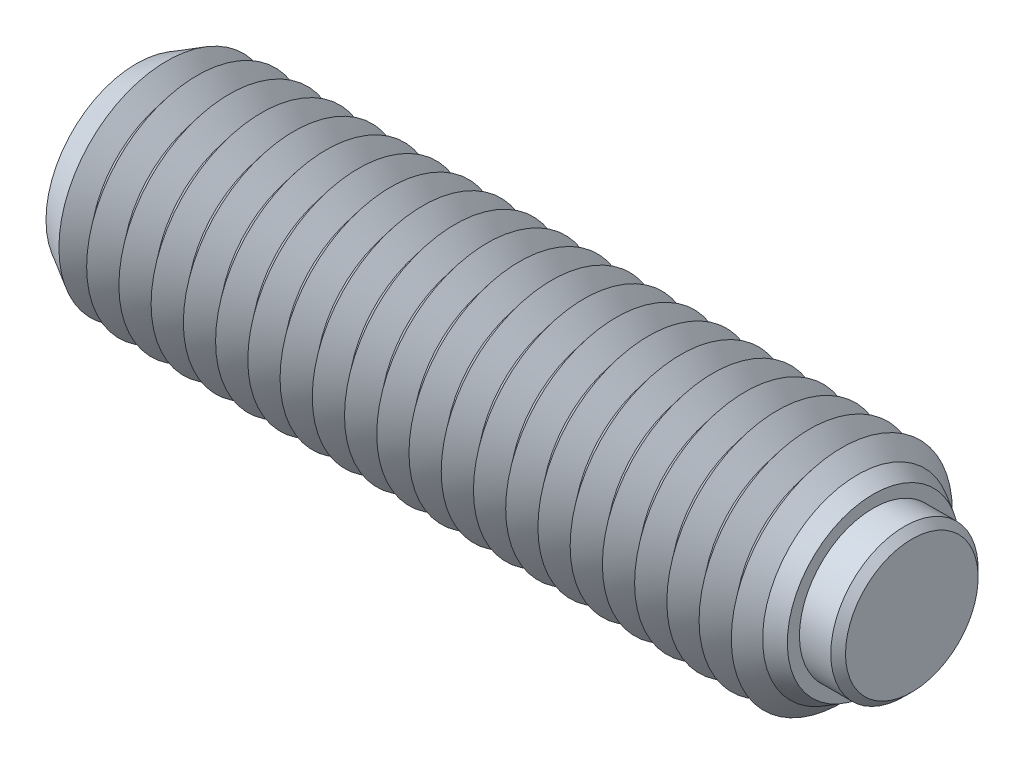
ISO-10303-21;
HEADER;
FILE_DESCRIPTION(('STEP AP214'),'2;1');
FILE_NAME('part.step','',(''),(''),'','','');
FILE_SCHEMA(('AUTOMOTIVE_DESIGN { 1 0 10303 214 1 1 1 1 }'));
ENDSEC;
DATA;
#1=APPLICATION_CONTEXT('core data for automotive mechanical design processes');
#2=APPLICATION_PROTOCOL_DEFINITION('international standard','automotive_design',2000,#1);
#3=PRODUCT_CONTEXT('',#1,'mechanical');
#4=PRODUCT('Part','Part','',(#3));
#5=PRODUCT_RELATED_PRODUCT_CATEGORY('part','',(#4));
#6=PRODUCT_DEFINITION_FORMATION('','',#4);
#7=PRODUCT_DEFINITION_CONTEXT('part definition',#1,'design');
#8=PRODUCT_DEFINITION('design','',#6,#7);
#9=PRODUCT_DEFINITION_SHAPE('','',#8);
#10=(LENGTH_UNIT() NAMED_UNIT(*) SI_UNIT(.MILLI.,.METRE.));
#11=(NAMED_UNIT(*) PLANE_ANGLE_UNIT() SI_UNIT($,.RADIAN.));
#12=(NAMED_UNIT(*) SI_UNIT($,.STERADIAN.) SOLID_ANGLE_UNIT());
#13=UNCERTAINTY_MEASURE_WITH_UNIT(LENGTH_MEASURE(1.E-05),#10,'distance_accuracy_value','');
#14=(GEOMETRIC_REPRESENTATION_CONTEXT(3) GLOBAL_UNCERTAINTY_ASSIGNED_CONTEXT((#13)) GLOBAL_UNIT_ASSIGNED_CONTEXT((#10,
#11,#12)) REPRESENTATION_CONTEXT('',''));
#15=CARTESIAN_POINT('',(0.,0.,0.));
#16=DIRECTION('',(0.,0.,1.));
#17=DIRECTION('',(1.,0.,0.));
#18=AXIS2_PLACEMENT_3D('',#15,#16,#17);
#19=CARTESIAN_POINT('',(2.95,0.,0.));
#20=DIRECTION('',(-1.,0.,0.));
#21=DIRECTION('',(0.,0.,1.));
#22=AXIS2_PLACEMENT_3D('',#19,#20,#21);
#23=CYLINDRICAL_SURFACE('',#22,4.);
#24=CARTESIAN_POINT('',(2.55,0.,0.));
#25=DIRECTION('',(1.,0.,0.));
#26=DIRECTION('',(0.,0.,-1.));
#27=AXIS2_PLACEMENT_3D('',#24,#25,#26);
#28=CIRCLE('',#27,4.);
#29=CARTESIAN_POINT('',(2.55,0.,4.));
#30=VERTEX_POINT('',#29);
#31=EDGE_CURVE('P0_E10',#30,#30,#28,.F.);
#32=ORIENTED_EDGE('',*,*,#31,.T.);
#33=EDGE_LOOP('',(#32));
#34=FACE_BOUND('',#33,.T.);
#35=CARTESIAN_POINT('',(-1.25,0.,0.));
#36=DIRECTION('',(1.,0.,0.));
#37=DIRECTION('',(0.,0.,-1.));
#38=AXIS2_PLACEMENT_3D('',#35,#36,#37);
#39=CIRCLE('',#38,4.);
#40=CARTESIAN_POINT('',(-1.25,0.,-4.));
#41=VERTEX_POINT('',#40);
#42=EDGE_CURVE('P0_E25',#41,#41,#39,.T.);
#43=ORIENTED_EDGE('',*,*,#42,.T.);
#44=EDGE_LOOP('',(#43));
#45=FACE_BOUND('',#44,.T.);
#46=ADVANCED_FACE('P0_F14',(#34,#45),#23,.T.);
#47=CARTESIAN_POINT('',(2.95,0.,0.));
#48=DIRECTION('',(1.,0.,0.));
#49=DIRECTION('',(0.,0.,-1.));
#50=AXIS2_PLACEMENT_3D('',#47,#48,#49);
#51=PLANE('',#50);
#52=CARTESIAN_POINT('',(2.95,0.,0.));
#53=DIRECTION('',(1.,0.,0.));
#54=DIRECTION('',(0.,0.,-1.));
#55=AXIS2_PLACEMENT_3D('',#52,#53,#54);
#56=CIRCLE('',#55,3.6);
#57=CARTESIAN_POINT('',(2.95,0.,3.6));
#58=VERTEX_POINT('',#57);
#59=EDGE_CURVE('P0_E21',#58,#58,#56,.T.);
#60=ORIENTED_EDGE('',*,*,#59,.T.);
#61=EDGE_LOOP('',(#60));
#62=FACE_BOUND('',#61,.T.);
#63=ADVANCED_FACE('P0_F35',(#62),#51,.T.);
#64=CARTESIAN_POINT('',(-1.25,0.,0.));
#65=DIRECTION('',(1.,0.,0.));
#66=DIRECTION('',(0.,0.,-1.));
#67=AXIS2_PLACEMENT_3D('',#64,#65,#66);
#68=PLANE('',#67);
#69=ORIENTED_EDGE('',*,*,#42,.F.);
#70=EDGE_LOOP('',(#69));
#71=FACE_BOUND('',#70,.T.);
#72=ADVANCED_FACE('P0_F33',(#71),#68,.F.);
#73=CARTESIAN_POINT('',(2.95,0.,0.));
#74=DIRECTION('',(-1.,0.,0.));
#75=DIRECTION('',(0.,0.,1.));
#76=AXIS2_PLACEMENT_3D('',#73,#74,#75);
#77=CONICAL_SURFACE('',#76,3.6,0.785398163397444);
#78=CARTESIAN_POINT('',(2.55,0.,4.));
#79=CARTESIAN_POINT('',(2.55416666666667,0.,3.99583333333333));
#80=CARTESIAN_POINT('',(2.55833333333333,0.,3.99166666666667));
#81=CARTESIAN_POINT('',(2.56666666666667,0.,3.98333333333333));
#82=CARTESIAN_POINT('',(2.57083333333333,0.,3.97916666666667));
#83=CARTESIAN_POINT('',(2.57916666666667,0.,3.97083333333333));
#84=CARTESIAN_POINT('',(2.58333333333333,0.,3.96666666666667));
#85=CARTESIAN_POINT('',(2.59166666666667,0.,3.95833333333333));
#86=CARTESIAN_POINT('',(2.59583333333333,0.,3.95416666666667));
#87=CARTESIAN_POINT('',(2.60416666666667,0.,3.94583333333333));
#88=CARTESIAN_POINT('',(2.60833333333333,0.,3.94166666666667));
#89=CARTESIAN_POINT('',(2.61666666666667,0.,3.93333333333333));
#90=CARTESIAN_POINT('',(2.62083333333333,0.,3.92916666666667));
#91=CARTESIAN_POINT('',(2.62916666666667,0.,3.92083333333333));
#92=CARTESIAN_POINT('',(2.63333333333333,0.,3.91666666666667));
#93=CARTESIAN_POINT('',(2.64166666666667,0.,3.90833333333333));
#94=CARTESIAN_POINT('',(2.64583333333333,0.,3.90416666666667));
#95=CARTESIAN_POINT('',(2.65416666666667,0.,3.89583333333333));
#96=CARTESIAN_POINT('',(2.65833333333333,0.,3.89166666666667));
#97=CARTESIAN_POINT('',(2.66666666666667,0.,3.88333333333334));
#98=CARTESIAN_POINT('',(2.67083333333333,0.,3.87916666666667));
#99=CARTESIAN_POINT('',(2.67916666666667,0.,3.87083333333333));
#100=CARTESIAN_POINT('',(2.68333333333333,0.,3.86666666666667));
#101=CARTESIAN_POINT('',(2.69166666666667,0.,3.85833333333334));
#102=CARTESIAN_POINT('',(2.69583333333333,0.,3.85416666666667));
#103=CARTESIAN_POINT('',(2.70416666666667,0.,3.84583333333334));
#104=CARTESIAN_POINT('',(2.70833333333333,0.,3.84166666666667));
#105=CARTESIAN_POINT('',(2.71666666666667,0.,3.83333333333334));
#106=CARTESIAN_POINT('',(2.72083333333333,0.,3.82916666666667));
#107=CARTESIAN_POINT('',(2.72916666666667,0.,3.82083333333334));
#108=CARTESIAN_POINT('',(2.73333333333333,0.,3.81666666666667));
#109=CARTESIAN_POINT('',(2.74166666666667,0.,3.80833333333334));
#110=CARTESIAN_POINT('',(2.74583333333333,0.,3.80416666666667));
#111=CARTESIAN_POINT('',(2.75416666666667,0.,3.79583333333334));
#112=CARTESIAN_POINT('',(2.75833333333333,0.,3.79166666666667));
#113=CARTESIAN_POINT('',(2.76666666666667,0.,3.78333333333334));
#114=CARTESIAN_POINT('',(2.77083333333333,0.,3.77916666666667));
#115=CARTESIAN_POINT('',(2.77916666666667,0.,3.77083333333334));
#116=CARTESIAN_POINT('',(2.78333333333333,0.,3.76666666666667));
#117=CARTESIAN_POINT('',(2.79166666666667,0.,3.75833333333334));
#118=CARTESIAN_POINT('',(2.79583333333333,0.,3.75416666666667));
#119=CARTESIAN_POINT('',(2.80416666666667,0.,3.74583333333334));
#120=CARTESIAN_POINT('',(2.80833333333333,0.,3.74166666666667));
#121=CARTESIAN_POINT('',(2.81666666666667,0.,3.73333333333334));
#122=CARTESIAN_POINT('',(2.82083333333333,0.,3.72916666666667));
#123=CARTESIAN_POINT('',(2.82916666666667,0.,3.72083333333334));
#124=CARTESIAN_POINT('',(2.83333333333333,0.,3.71666666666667));
#125=CARTESIAN_POINT('',(2.84166666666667,0.,3.70833333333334));
#126=CARTESIAN_POINT('',(2.84583333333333,0.,3.70416666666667));
#127=CARTESIAN_POINT('',(2.85416666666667,0.,3.69583333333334));
#128=CARTESIAN_POINT('',(2.85833333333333,0.,3.69166666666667));
#129=CARTESIAN_POINT('',(2.86666666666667,0.,3.68333333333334));
#130=CARTESIAN_POINT('',(2.87083333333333,0.,3.67916666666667));
#131=CARTESIAN_POINT('',(2.87916666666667,0.,3.67083333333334));
#132=CARTESIAN_POINT('',(2.88333333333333,0.,3.66666666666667));
#133=CARTESIAN_POINT('',(2.89166666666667,0.,3.65833333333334));
#134=CARTESIAN_POINT('',(2.89583333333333,0.,3.65416666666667));
#135=CARTESIAN_POINT('',(2.90416666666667,0.,3.64583333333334));
#136=CARTESIAN_POINT('',(2.90833333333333,0.,3.64166666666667));
#137=CARTESIAN_POINT('',(2.91666666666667,0.,3.63333333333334));
#138=CARTESIAN_POINT('',(2.92083333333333,0.,3.62916666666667));
#139=CARTESIAN_POINT('',(2.92916666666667,0.,3.62083333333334));
#140=CARTESIAN_POINT('',(2.93333333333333,0.,3.61666666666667));
#141=CARTESIAN_POINT('',(2.94166666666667,0.,3.60833333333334));
#142=CARTESIAN_POINT('',(2.94583333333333,0.,3.60416666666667));
#143=CARTESIAN_POINT('',(2.95,0.,3.6));
#144=B_SPLINE_CURVE_WITH_KNOTS('',3,(#78,#79,#80,#81,#82,#83,#84,#85,#86,#87,#88,#89,#90,#91,
#92,#93,#94,#95,#96,#97,#98,#99,#100,#101,#102,#103,#104,#105,#106,#107,#108,#109,#110,#111,
#112,#113,#114,#115,#116,#117,#118,#119,#120,#121,#122,#123,#124,#125,#126,#127,#128,#129,#130,
#131,#132,#133,#134,#135,#136,#137,#138,#139,#140,#141,#142,#143),.UNSPECIFIED.,.F.,.F.,(4,2,2,
2,2,2,2,2,2,2,2,2,2,2,2,2,2,2,2,2,2,2,2,2,2,2,2,2,2,2,2,2,4),(0.,0.0176776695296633,
0.0353553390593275,0.0530330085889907,0.070710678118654,0.0883883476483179,0.106066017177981,
0.123743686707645,0.141421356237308,0.159099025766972,0.176776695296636,0.194454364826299,
0.212132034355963,0.229809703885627,0.24748737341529,0.265165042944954,0.282842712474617,
0.300520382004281,0.318198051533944,0.335875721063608,0.353553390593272,0.371231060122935,
0.388908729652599,0.406586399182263,0.424264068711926,0.44194173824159,0.459619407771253,
0.477297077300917,0.49497474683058,0.512652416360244,0.530330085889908,0.548007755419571,
0.565685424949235),.UNSPECIFIED.);
#145=EDGE_CURVE('P0_BSEAM16',#30,#58,#144,.T.);
#146=ORIENTED_EDGE('',*,*,#31,.F.);
#147=ORIENTED_EDGE('',*,*,#59,.F.);
#148=ORIENTED_EDGE('',*,*,#145,.T.);
#149=ORIENTED_EDGE('',*,*,#145,.F.);
#150=EDGE_LOOP('',(#146,#148,#147,#149));
#151=FACE_BOUND('',#150,.T.);
#152=ADVANCED_FACE('P0_F16',(#151),#77,.T.);
#153=CLOSED_SHELL('',(#46,#63,#72,#152));
#154=MANIFOLD_SOLID_BREP('P0_B1',#153);
#155=CARTESIAN_POINT('',(-37.6,0.,0.));
#156=DIRECTION('',(-1.,0.,0.));
#157=DIRECTION('',(0.,0.,1.));
#158=AXIS2_PLACEMENT_3D('',#155,#156,#157);
#159=CONICAL_SURFACE('',#158,6.,0.895664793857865);
#160=CARTESIAN_POINT('',(-36.725,0.,0.));
#161=DIRECTION('',(1.,0.,0.));
#162=DIRECTION('',(0.,0.,-1.));
#163=AXIS2_PLACEMENT_3D('',#160,#161,#162);
#164=CIRCLE('',#163,4.90712535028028);
#165=CARTESIAN_POINT('',(-36.725,0.,-4.90712535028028));
#166=VERTEX_POINT('',#165);
#167=EDGE_CURVE('P1_E1035',#166,#166,#164,.T.);
#168=ORIENTED_EDGE('',*,*,#167,.F.);
#169=EDGE_LOOP('',(#168));
#170=FACE_BOUND('',#169,.T.);
#171=CARTESIAN_POINT('',(-37.4915970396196,0.,0.));
#172=DIRECTION('',(1.,0.,0.));
#173=DIRECTION('',(0.,0.,-1.));
#174=AXIS2_PLACEMENT_3D('',#171,#172,#173);
#175=CIRCLE('',#174,5.86460474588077);
#176=CARTESIAN_POINT('',(-37.4915970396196,0.,-5.86460474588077));
#177=VERTEX_POINT('',#176);
#178=EDGE_CURVE('P1_E1038',#177,#177,#175,.F.);
#179=ORIENTED_EDGE('',*,*,#178,.F.);
#180=EDGE_LOOP('',(#179));
#181=FACE_BOUND('',#180,.T.);
#182=ADVANCED_FACE('P1_F15',(#170,#181),#159,.T.);
#183=CARTESIAN_POINT('',(-1.72500000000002,0.,0.));
#184=DIRECTION('',(1.,0.,0.));
#185=DIRECTION('',(0.,0.,-1.));
#186=AXIS2_PLACEMENT_3D('',#183,#184,#185);
#187=CONICAL_SURFACE('',#186,4.90712535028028,0.895664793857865);
#188=CARTESIAN_POINT('',(-0.850000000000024,0.,0.));
#189=DIRECTION('',(1.,0.,0.));
#190=DIRECTION('',(0.,0.,-1.));
#191=AXIS2_PLACEMENT_3D('',#188,#189,#190);
#192=CIRCLE('',#191,6.);
#193=CARTESIAN_POINT('',(-0.850000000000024,0.,-6.));
#194=VERTEX_POINT('',#193);
#195=EDGE_CURVE('P1_E911',#194,#194,#192,.T.);
#196=ORIENTED_EDGE('',*,*,#195,.F.);
#197=EDGE_LOOP('',(#196));
#198=FACE_BOUND('',#197,.T.);
#199=CARTESIAN_POINT('',(-1.72500000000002,0.,0.));
#200=DIRECTION('',(1.,0.,0.));
#201=DIRECTION('',(0.,0.,-1.));
#202=AXIS2_PLACEMENT_3D('',#199,#200,#201);
#203=CIRCLE('',#202,4.90712535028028);
#204=CARTESIAN_POINT('',(-1.72500000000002,0.,-4.90712535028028));
#205=VERTEX_POINT('',#204);
#206=EDGE_CURVE('P1_E912',#205,#205,#203,.T.);
#207=ORIENTED_EDGE('',*,*,#206,.T.);
#208=EDGE_LOOP('',(#207));
#209=FACE_BOUND('',#208,.T.);
#210=ADVANCED_FACE('P1_F222',(#198,#209),#187,.T.);
#211=CARTESIAN_POINT('',(-2.60000000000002,0.,0.));
#212=DIRECTION('',(-1.,0.,0.));
#213=DIRECTION('',(0.,0.,1.));
#214=AXIS2_PLACEMENT_3D('',#211,#212,#213);
#215=CONICAL_SURFACE('',#214,6.,0.895664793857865);
#216=ORIENTED_EDGE('',*,*,#206,.F.);
#217=EDGE_LOOP('',(#216));
#218=FACE_BOUND('',#217,.T.);
#219=CARTESIAN_POINT('',(-2.60000000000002,0.,0.));
#220=DIRECTION('',(1.,0.,0.));
#221=DIRECTION('',(0.,0.,-1.));
#222=AXIS2_PLACEMENT_3D('',#219,#220,#221);
#223=CIRCLE('',#222,6.);
#224=CARTESIAN_POINT('',(-2.60000000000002,0.,-6.));
#225=VERTEX_POINT('',#224);
#226=EDGE_CURVE('P1_E916',#225,#225,#223,.T.);
#227=ORIENTED_EDGE('',*,*,#226,.T.);
#228=EDGE_LOOP('',(#227));
#229=FACE_BOUND('',#228,.T.);
#230=ADVANCED_FACE('P1_F227',(#218,#229),#215,.T.);
#231=CARTESIAN_POINT('',(-1.25,0.,0.));
#232=DIRECTION('',(1.,0.,0.));
#233=DIRECTION('',(0.,1.,0.));
#234=AXIS2_PLACEMENT_3D('',#231,#232,#233);
#235=PLANE('',#234);
#236=CARTESIAN_POINT('',(-1.25,0.,0.));
#237=DIRECTION('',(1.,0.,0.));
#238=DIRECTION('',(0.,1.,0.));
#239=AXIS2_PLACEMENT_3D('',#236,#237,#238);
#240=CIRCLE('',#239,4.);
#241=CARTESIAN_POINT('',(-1.25,4.,0.));
#242=VERTEX_POINT('',#241);
#243=EDGE_CURVE('P1_E462',#242,#242,#240,.T.);
#244=ORIENTED_EDGE('',*,*,#243,.T.);
#245=EDGE_LOOP('',(#244));
#246=FACE_BOUND('',#245,.T.);
#247=ADVANCED_FACE('P1_F389',(#246),#235,.T.);
#248=CARTESIAN_POINT('',(-1.25,0.,0.));
#249=DIRECTION('',(1.,0.,0.));
#250=DIRECTION('',(0.,1.,0.));
#251=AXIS2_PLACEMENT_3D('',#248,#249,#250);
#252=CYLINDRICAL_SURFACE('',#251,4.);
#253=ORIENTED_EDGE('',*,*,#243,.F.);
#254=EDGE_LOOP('',(#253));
#255=FACE_BOUND('',#254,.T.);
#256=CARTESIAN_POINT('',(0.85,0.,0.));
#257=DIRECTION('',(1.,0.,0.));
#258=DIRECTION('',(0.,1.,0.));
#259=AXIS2_PLACEMENT_3D('',#256,#257,#258);
#260=CIRCLE('',#259,4.);
#261=CARTESIAN_POINT('',(0.85,4.,0.));
#262=VERTEX_POINT('',#261);
#263=EDGE_CURVE('P1_E465',#262,#262,#260,.T.);
#264=ORIENTED_EDGE('',*,*,#263,.T.);
#265=EDGE_LOOP('',(#264));
#266=FACE_BOUND('',#265,.T.);
#267=ADVANCED_FACE('P1_F209',(#255,#266),#252,.F.);
#268=CARTESIAN_POINT('',(0.849999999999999,4.65925227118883,0.));
#269=DIRECTION('',(1.,0.,0.));
#270=DIRECTION('',(0.,1.,0.));
#271=AXIS2_PLACEMENT_3D('',#268,#269,#270);
#272=PLANE('',#271);
#273=ORIENTED_EDGE('',*,*,#263,.F.);
#274=EDGE_LOOP('',(#273));
#275=FACE_BOUND('',#274,.T.);
#276=CARTESIAN_POINT('',(0.85,0.,0.));
#277=DIRECTION('',(1.,0.,0.));
#278=DIRECTION('',(0.,1.,0.));
#279=AXIS2_PLACEMENT_3D('',#276,#277,#278);
#280=CIRCLE('',#279,4.65925227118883);
#281=CARTESIAN_POINT('',(0.849999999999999,4.65925227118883,0.));
#282=VERTEX_POINT('',#281);
#283=EDGE_CURVE('P1_E121',#282,#282,#280,.T.);
#284=ORIENTED_EDGE('',*,*,#283,.T.);
#285=EDGE_LOOP('',(#284));
#286=FACE_BOUND('',#285,.T.);
#287=ADVANCED_FACE('P1_F206',(#275,#286),#272,.T.);
#288=CARTESIAN_POINT('',(0.85,0.,0.));
#289=DIRECTION('',(-1.,0.,0.));
#290=DIRECTION('',(0.,-1.,0.));
#291=AXIS2_PLACEMENT_3D('',#288,#289,#290);
#292=CONICAL_SURFACE('',#291,4.65925227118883,0.523598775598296);
#293=CARTESIAN_POINT('',(0.,0.,0.));
#294=DIRECTION('',(1.,0.,0.));
#295=DIRECTION('',(0.,0.,-1.));
#296=AXIS2_PLACEMENT_3D('',#293,#294,#295);
#297=CIRCLE('',#296,5.15);
#298=CARTESIAN_POINT('',(0.,0.,-5.15));
#299=VERTEX_POINT('',#298);
#300=EDGE_CURVE('P1_E453',#299,#299,#297,.T.);
#301=ORIENTED_EDGE('',*,*,#300,.T.);
#302=EDGE_LOOP('',(#301));
#303=FACE_BOUND('',#302,.T.);
#304=ORIENTED_EDGE('',*,*,#283,.F.);
#305=EDGE_LOOP('',(#304));
#306=FACE_BOUND('',#305,.T.);
#307=ADVANCED_FACE('P1_F203',(#303,#306),#292,.T.);
#308=CARTESIAN_POINT('',(0.,0.,0.));
#309=DIRECTION('',(-1.,0.,0.));
#310=DIRECTION('',(0.,0.,1.));
#311=AXIS2_PLACEMENT_3D('',#308,#309,#310);
#312=CONICAL_SURFACE('',#311,5.15,0.785398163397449);
#313=ORIENTED_EDGE('',*,*,#195,.T.);
#314=EDGE_LOOP('',(#313));
#315=FACE_BOUND('',#314,.T.);
#316=ORIENTED_EDGE('',*,*,#300,.F.);
#317=EDGE_LOOP('',(#316));
#318=FACE_BOUND('',#317,.T.);
#319=ADVANCED_FACE('P1_F17',(#315,#318),#312,.T.);
#320=CARTESIAN_POINT('',(-3.47500000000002,0.,0.));
#321=DIRECTION('',(1.,0.,0.));
#322=DIRECTION('',(0.,0.,-1.));
#323=AXIS2_PLACEMENT_3D('',#320,#321,#322);
#324=CONICAL_SURFACE('',#323,4.90712535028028,0.895664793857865);
#325=ORIENTED_EDGE('',*,*,#226,.F.);
#326=EDGE_LOOP('',(#325));
#327=FACE_BOUND('',#326,.T.);
#328=CARTESIAN_POINT('',(-3.47500000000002,0.,0.));
#329=DIRECTION('',(1.,0.,0.));
#330=DIRECTION('',(0.,0.,-1.));
#331=AXIS2_PLACEMENT_3D('',#328,#329,#330);
#332=CIRCLE('',#331,4.90712535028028);
#333=CARTESIAN_POINT('',(-3.47500000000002,0.,-4.90712535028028));
#334=VERTEX_POINT('',#333);
#335=EDGE_CURVE('P1_E921',#334,#334,#332,.T.);
#336=ORIENTED_EDGE('',*,*,#335,.T.);
#337=EDGE_LOOP('',(#336));
#338=FACE_BOUND('',#337,.T.);
#339=ADVANCED_FACE('P1_F383',(#327,#338),#324,.T.);
#340=CARTESIAN_POINT('',(-4.35000000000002,0.,0.));
#341=DIRECTION('',(-1.,0.,0.));
#342=DIRECTION('',(0.,0.,1.));
#343=AXIS2_PLACEMENT_3D('',#340,#341,#342);
#344=CONICAL_SURFACE('',#343,6.,0.895664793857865);
#345=ORIENTED_EDGE('',*,*,#335,.F.);
#346=EDGE_LOOP('',(#345));
#347=FACE_BOUND('',#346,.T.);
#348=CARTESIAN_POINT('',(-4.35000000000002,0.,0.));
#349=DIRECTION('',(1.,0.,0.));
#350=DIRECTION('',(0.,0.,-1.));
#351=AXIS2_PLACEMENT_3D('',#348,#349,#350);
#352=CIRCLE('',#351,6.);
#353=CARTESIAN_POINT('',(-4.35000000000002,0.,-6.));
#354=VERTEX_POINT('',#353);
#355=EDGE_CURVE('P1_E924',#354,#354,#352,.T.);
#356=ORIENTED_EDGE('',*,*,#355,.T.);
#357=EDGE_LOOP('',(#356));
#358=FACE_BOUND('',#357,.T.);
#359=ADVANCED_FACE('P1_F379',(#347,#358),#344,.T.);
#360=CARTESIAN_POINT('',(-5.22500000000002,0.,0.));
#361=DIRECTION('',(1.,0.,0.));
#362=DIRECTION('',(0.,0.,-1.));
#363=AXIS2_PLACEMENT_3D('',#360,#361,#362);
#364=CONICAL_SURFACE('',#363,4.90712535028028,0.895664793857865);
#365=ORIENTED_EDGE('',*,*,#355,.F.);
#366=EDGE_LOOP('',(#365));
#367=FACE_BOUND('',#366,.T.);
#368=CARTESIAN_POINT('',(-5.22500000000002,0.,0.));
#369=DIRECTION('',(1.,0.,0.));
#370=DIRECTION('',(0.,0.,-1.));
#371=AXIS2_PLACEMENT_3D('',#368,#369,#370);
#372=CIRCLE('',#371,4.90712535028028);
#373=CARTESIAN_POINT('',(-5.22500000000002,0.,-4.90712535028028));
#374=VERTEX_POINT('',#373);
#375=EDGE_CURVE('P1_E927',#374,#374,#372,.T.);
#376=ORIENTED_EDGE('',*,*,#375,.T.);
#377=EDGE_LOOP('',(#376));
#378=FACE_BOUND('',#377,.T.);
#379=ADVANCED_FACE('P1_F375',(#367,#378),#364,.T.);
#380=CARTESIAN_POINT('',(-6.10000000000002,0.,0.));
#381=DIRECTION('',(-1.,0.,0.));
#382=DIRECTION('',(0.,0.,1.));
#383=AXIS2_PLACEMENT_3D('',#380,#381,#382);
#384=CONICAL_SURFACE('',#383,6.,0.895664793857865);
#385=ORIENTED_EDGE('',*,*,#375,.F.);
#386=EDGE_LOOP('',(#385));
#387=FACE_BOUND('',#386,.T.);
#388=CARTESIAN_POINT('',(-6.10000000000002,0.,0.));
#389=DIRECTION('',(1.,0.,0.));
#390=DIRECTION('',(0.,0.,-1.));
#391=AXIS2_PLACEMENT_3D('',#388,#389,#390);
#392=CIRCLE('',#391,6.);
#393=CARTESIAN_POINT('',(-6.10000000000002,0.,-6.));
#394=VERTEX_POINT('',#393);
#395=EDGE_CURVE('P1_E930',#394,#394,#392,.T.);
#396=ORIENTED_EDGE('',*,*,#395,.T.);
#397=EDGE_LOOP('',(#396));
#398=FACE_BOUND('',#397,.T.);
#399=ADVANCED_FACE('P1_F371',(#387,#398),#384,.T.);
#400=CARTESIAN_POINT('',(-6.97500000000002,0.,0.));
#401=DIRECTION('',(1.,0.,0.));
#402=DIRECTION('',(0.,0.,-1.));
#403=AXIS2_PLACEMENT_3D('',#400,#401,#402);
#404=CONICAL_SURFACE('',#403,4.90712535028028,0.895664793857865);
#405=ORIENTED_EDGE('',*,*,#395,.F.);
#406=EDGE_LOOP('',(#405));
#407=FACE_BOUND('',#406,.T.);
#408=CARTESIAN_POINT('',(-6.97500000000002,0.,0.));
#409=DIRECTION('',(1.,0.,0.));
#410=DIRECTION('',(0.,0.,-1.));
#411=AXIS2_PLACEMENT_3D('',#408,#409,#410);
#412=CIRCLE('',#411,4.90712535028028);
#413=CARTESIAN_POINT('',(-6.97500000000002,0.,-4.90712535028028));
#414=VERTEX_POINT('',#413);
#415=EDGE_CURVE('P1_E933',#414,#414,#412,.T.);
#416=ORIENTED_EDGE('',*,*,#415,.T.);
#417=EDGE_LOOP('',(#416));
#418=FACE_BOUND('',#417,.T.);
#419=ADVANCED_FACE('P1_F367',(#407,#418),#404,.T.);
#420=CARTESIAN_POINT('',(-7.85000000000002,0.,0.));
#421=DIRECTION('',(-1.,0.,0.));
#422=DIRECTION('',(0.,0.,1.));
#423=AXIS2_PLACEMENT_3D('',#420,#421,#422);
#424=CONICAL_SURFACE('',#423,6.,0.895664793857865);
#425=ORIENTED_EDGE('',*,*,#415,.F.);
#426=EDGE_LOOP('',(#425));
#427=FACE_BOUND('',#426,.T.);
#428=CARTESIAN_POINT('',(-7.85000000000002,0.,0.));
#429=DIRECTION('',(1.,0.,0.));
#430=DIRECTION('',(0.,0.,-1.));
#431=AXIS2_PLACEMENT_3D('',#428,#429,#430);
#432=CIRCLE('',#431,6.);
#433=CARTESIAN_POINT('',(-7.85000000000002,0.,-6.));
#434=VERTEX_POINT('',#433);
#435=EDGE_CURVE('P1_E936',#434,#434,#432,.T.);
#436=ORIENTED_EDGE('',*,*,#435,.T.);
#437=EDGE_LOOP('',(#436));
#438=FACE_BOUND('',#437,.T.);
#439=ADVANCED_FACE('P1_F363',(#427,#438),#424,.T.);
#440=CARTESIAN_POINT('',(-8.72500000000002,0.,0.));
#441=DIRECTION('',(1.,0.,0.));
#442=DIRECTION('',(0.,0.,-1.));
#443=AXIS2_PLACEMENT_3D('',#440,#441,#442);
#444=CONICAL_SURFACE('',#443,4.90712535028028,0.895664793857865);
#445=ORIENTED_EDGE('',*,*,#435,.F.);
#446=EDGE_LOOP('',(#445));
#447=FACE_BOUND('',#446,.T.);
#448=CARTESIAN_POINT('',(-8.72500000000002,0.,0.));
#449=DIRECTION('',(1.,0.,0.));
#450=DIRECTION('',(0.,0.,-1.));
#451=AXIS2_PLACEMENT_3D('',#448,#449,#450);
#452=CIRCLE('',#451,4.90712535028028);
#453=CARTESIAN_POINT('',(-8.72500000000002,0.,-4.90712535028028));
#454=VERTEX_POINT('',#453);
#455=EDGE_CURVE('P1_E939',#454,#454,#452,.T.);
#456=ORIENTED_EDGE('',*,*,#455,.T.);
#457=EDGE_LOOP('',(#456));
#458=FACE_BOUND('',#457,.T.);
#459=ADVANCED_FACE('P1_F359',(#447,#458),#444,.T.);
#460=CARTESIAN_POINT('',(-9.60000000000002,0.,0.));
#461=DIRECTION('',(-1.,0.,0.));
#462=DIRECTION('',(0.,0.,1.));
#463=AXIS2_PLACEMENT_3D('',#460,#461,#462);
#464=CONICAL_SURFACE('',#463,6.,0.895664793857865);
#465=ORIENTED_EDGE('',*,*,#455,.F.);
#466=EDGE_LOOP('',(#465));
#467=FACE_BOUND('',#466,.T.);
#468=CARTESIAN_POINT('',(-9.60000000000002,0.,0.));
#469=DIRECTION('',(1.,0.,0.));
#470=DIRECTION('',(0.,0.,-1.));
#471=AXIS2_PLACEMENT_3D('',#468,#469,#470);
#472=CIRCLE('',#471,6.);
#473=CARTESIAN_POINT('',(-9.60000000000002,0.,-6.));
#474=VERTEX_POINT('',#473);
#475=EDGE_CURVE('P1_E942',#474,#474,#472,.T.);
#476=ORIENTED_EDGE('',*,*,#475,.T.);
#477=EDGE_LOOP('',(#476));
#478=FACE_BOUND('',#477,.T.);
#479=ADVANCED_FACE('P1_F355',(#467,#478),#464,.T.);
#480=CARTESIAN_POINT('',(-10.475,0.,0.));
#481=DIRECTION('',(1.,0.,0.));
#482=DIRECTION('',(0.,0.,-1.));
#483=AXIS2_PLACEMENT_3D('',#480,#481,#482);
#484=CONICAL_SURFACE('',#483,4.90712535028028,0.895664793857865);
#485=ORIENTED_EDGE('',*,*,#475,.F.);
#486=EDGE_LOOP('',(#485));
#487=FACE_BOUND('',#486,.T.);
#488=CARTESIAN_POINT('',(-10.475,0.,0.));
#489=DIRECTION('',(1.,0.,0.));
#490=DIRECTION('',(0.,0.,-1.));
#491=AXIS2_PLACEMENT_3D('',#488,#489,#490);
#492=CIRCLE('',#491,4.90712535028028);
#493=CARTESIAN_POINT('',(-10.475,0.,-4.90712535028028));
#494=VERTEX_POINT('',#493);
#495=EDGE_CURVE('P1_E945',#494,#494,#492,.T.);
#496=ORIENTED_EDGE('',*,*,#495,.T.);
#497=EDGE_LOOP('',(#496));
#498=FACE_BOUND('',#497,.T.);
#499=ADVANCED_FACE('P1_F351',(#487,#498),#484,.T.);
#500=CARTESIAN_POINT('',(-11.35,0.,0.));
#501=DIRECTION('',(-1.,0.,0.));
#502=DIRECTION('',(0.,0.,1.));
#503=AXIS2_PLACEMENT_3D('',#500,#501,#502);
#504=CONICAL_SURFACE('',#503,6.,0.895664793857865);
#505=ORIENTED_EDGE('',*,*,#495,.F.);
#506=EDGE_LOOP('',(#505));
#507=FACE_BOUND('',#506,.T.);
#508=CARTESIAN_POINT('',(-11.35,0.,0.));
#509=DIRECTION('',(1.,0.,0.));
#510=DIRECTION('',(0.,0.,-1.));
#511=AXIS2_PLACEMENT_3D('',#508,#509,#510);
#512=CIRCLE('',#511,6.);
#513=CARTESIAN_POINT('',(-11.35,0.,-6.));
#514=VERTEX_POINT('',#513);
#515=EDGE_CURVE('P1_E948',#514,#514,#512,.T.);
#516=ORIENTED_EDGE('',*,*,#515,.T.);
#517=EDGE_LOOP('',(#516));
#518=FACE_BOUND('',#517,.T.);
#519=ADVANCED_FACE('P1_F347',(#507,#518),#504,.T.);
#520=CARTESIAN_POINT('',(-12.225,0.,0.));
#521=DIRECTION('',(1.,0.,0.));
#522=DIRECTION('',(0.,0.,-1.));
#523=AXIS2_PLACEMENT_3D('',#520,#521,#522);
#524=CONICAL_SURFACE('',#523,4.90712535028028,0.895664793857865);
#525=ORIENTED_EDGE('',*,*,#515,.F.);
#526=EDGE_LOOP('',(#525));
#527=FACE_BOUND('',#526,.T.);
#528=CARTESIAN_POINT('',(-12.225,0.,0.));
#529=DIRECTION('',(1.,0.,0.));
#530=DIRECTION('',(0.,0.,-1.));
#531=AXIS2_PLACEMENT_3D('',#528,#529,#530);
#532=CIRCLE('',#531,4.90712535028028);
#533=CARTESIAN_POINT('',(-12.225,0.,-4.90712535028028));
#534=VERTEX_POINT('',#533);
#535=EDGE_CURVE('P1_E951',#534,#534,#532,.T.);
#536=ORIENTED_EDGE('',*,*,#535,.T.);
#537=EDGE_LOOP('',(#536));
#538=FACE_BOUND('',#537,.T.);
#539=ADVANCED_FACE('P1_F343',(#527,#538),#524,.T.);
#540=CARTESIAN_POINT('',(-13.1,0.,0.));
#541=DIRECTION('',(-1.,0.,0.));
#542=DIRECTION('',(0.,0.,1.));
#543=AXIS2_PLACEMENT_3D('',#540,#541,#542);
#544=CONICAL_SURFACE('',#543,6.,0.895664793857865);
#545=ORIENTED_EDGE('',*,*,#535,.F.);
#546=EDGE_LOOP('',(#545));
#547=FACE_BOUND('',#546,.T.);
#548=CARTESIAN_POINT('',(-13.1,0.,0.));
#549=DIRECTION('',(1.,0.,0.));
#550=DIRECTION('',(0.,0.,-1.));
#551=AXIS2_PLACEMENT_3D('',#548,#549,#550);
#552=CIRCLE('',#551,6.);
#553=CARTESIAN_POINT('',(-13.1,0.,-6.));
#554=VERTEX_POINT('',#553);
#555=EDGE_CURVE('P1_E954',#554,#554,#552,.T.);
#556=ORIENTED_EDGE('',*,*,#555,.T.);
#557=EDGE_LOOP('',(#556));
#558=FACE_BOUND('',#557,.T.);
#559=ADVANCED_FACE('P1_F339',(#547,#558),#544,.T.);
#560=CARTESIAN_POINT('',(-13.975,0.,0.));
#561=DIRECTION('',(1.,0.,0.));
#562=DIRECTION('',(0.,0.,-1.));
#563=AXIS2_PLACEMENT_3D('',#560,#561,#562);
#564=CONICAL_SURFACE('',#563,4.90712535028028,0.895664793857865);
#565=ORIENTED_EDGE('',*,*,#555,.F.);
#566=EDGE_LOOP('',(#565));
#567=FACE_BOUND('',#566,.T.);
#568=CARTESIAN_POINT('',(-13.975,0.,0.));
#569=DIRECTION('',(1.,0.,0.));
#570=DIRECTION('',(0.,0.,-1.));
#571=AXIS2_PLACEMENT_3D('',#568,#569,#570);
#572=CIRCLE('',#571,4.90712535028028);
#573=CARTESIAN_POINT('',(-13.975,0.,-4.90712535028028));
#574=VERTEX_POINT('',#573);
#575=EDGE_CURVE('P1_E957',#574,#574,#572,.T.);
#576=ORIENTED_EDGE('',*,*,#575,.T.);
#577=EDGE_LOOP('',(#576));
#578=FACE_BOUND('',#577,.T.);
#579=ADVANCED_FACE('P1_F335',(#567,#578),#564,.T.);
#580=CARTESIAN_POINT('',(-14.85,0.,0.));
#581=DIRECTION('',(-1.,0.,0.));
#582=DIRECTION('',(0.,0.,1.));
#583=AXIS2_PLACEMENT_3D('',#580,#581,#582);
#584=CONICAL_SURFACE('',#583,6.,0.895664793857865);
#585=ORIENTED_EDGE('',*,*,#575,.F.);
#586=EDGE_LOOP('',(#585));
#587=FACE_BOUND('',#586,.T.);
#588=CARTESIAN_POINT('',(-14.85,0.,0.));
#589=DIRECTION('',(1.,0.,0.));
#590=DIRECTION('',(0.,0.,-1.));
#591=AXIS2_PLACEMENT_3D('',#588,#589,#590);
#592=CIRCLE('',#591,6.);
#593=CARTESIAN_POINT('',(-14.85,0.,-6.));
#594=VERTEX_POINT('',#593);
#595=EDGE_CURVE('P1_E960',#594,#594,#592,.T.);
#596=ORIENTED_EDGE('',*,*,#595,.T.);
#597=EDGE_LOOP('',(#596));
#598=FACE_BOUND('',#597,.T.);
#599=ADVANCED_FACE('P1_F331',(#587,#598),#584,.T.);
#600=CARTESIAN_POINT('',(-15.725,0.,0.));
#601=DIRECTION('',(1.,0.,0.));
#602=DIRECTION('',(0.,0.,-1.));
#603=AXIS2_PLACEMENT_3D('',#600,#601,#602);
#604=CONICAL_SURFACE('',#603,4.90712535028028,0.895664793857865);
#605=ORIENTED_EDGE('',*,*,#595,.F.);
#606=EDGE_LOOP('',(#605));
#607=FACE_BOUND('',#606,.T.);
#608=CARTESIAN_POINT('',(-15.725,0.,0.));
#609=DIRECTION('',(1.,0.,0.));
#610=DIRECTION('',(0.,0.,-1.));
#611=AXIS2_PLACEMENT_3D('',#608,#609,#610);
#612=CIRCLE('',#611,4.90712535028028);
#613=CARTESIAN_POINT('',(-15.725,0.,-4.90712535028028));
#614=VERTEX_POINT('',#613);
#615=EDGE_CURVE('P1_E963',#614,#614,#612,.T.);
#616=ORIENTED_EDGE('',*,*,#615,.T.);
#617=EDGE_LOOP('',(#616));
#618=FACE_BOUND('',#617,.T.);
#619=ADVANCED_FACE('P1_F327',(#607,#618),#604,.T.);
#620=CARTESIAN_POINT('',(-16.6,0.,0.));
#621=DIRECTION('',(-1.,0.,0.));
#622=DIRECTION('',(0.,0.,1.));
#623=AXIS2_PLACEMENT_3D('',#620,#621,#622);
#624=CONICAL_SURFACE('',#623,6.,0.895664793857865);
#625=ORIENTED_EDGE('',*,*,#615,.F.);
#626=EDGE_LOOP('',(#625));
#627=FACE_BOUND('',#626,.T.);
#628=CARTESIAN_POINT('',(-16.6,0.,0.));
#629=DIRECTION('',(1.,0.,0.));
#630=DIRECTION('',(0.,0.,-1.));
#631=AXIS2_PLACEMENT_3D('',#628,#629,#630);
#632=CIRCLE('',#631,6.);
#633=CARTESIAN_POINT('',(-16.6,0.,-6.));
#634=VERTEX_POINT('',#633);
#635=EDGE_CURVE('P1_E966',#634,#634,#632,.T.);
#636=ORIENTED_EDGE('',*,*,#635,.T.);
#637=EDGE_LOOP('',(#636));
#638=FACE_BOUND('',#637,.T.);
#639=ADVANCED_FACE('P1_F323',(#627,#638),#624,.T.);
#640=CARTESIAN_POINT('',(-17.475,0.,0.));
#641=DIRECTION('',(1.,0.,0.));
#642=DIRECTION('',(0.,0.,-1.));
#643=AXIS2_PLACEMENT_3D('',#640,#641,#642);
#644=CONICAL_SURFACE('',#643,4.90712535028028,0.895664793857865);
#645=ORIENTED_EDGE('',*,*,#635,.F.);
#646=EDGE_LOOP('',(#645));
#647=FACE_BOUND('',#646,.T.);
#648=CARTESIAN_POINT('',(-17.475,0.,0.));
#649=DIRECTION('',(1.,0.,0.));
#650=DIRECTION('',(0.,0.,-1.));
#651=AXIS2_PLACEMENT_3D('',#648,#649,#650);
#652=CIRCLE('',#651,4.90712535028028);
#653=CARTESIAN_POINT('',(-17.475,0.,-4.90712535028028));
#654=VERTEX_POINT('',#653);
#655=EDGE_CURVE('P1_E969',#654,#654,#652,.T.);
#656=ORIENTED_EDGE('',*,*,#655,.T.);
#657=EDGE_LOOP('',(#656));
#658=FACE_BOUND('',#657,.T.);
#659=ADVANCED_FACE('P1_F319',(#647,#658),#644,.T.);
#660=CARTESIAN_POINT('',(-18.35,0.,0.));
#661=DIRECTION('',(-1.,0.,0.));
#662=DIRECTION('',(0.,0.,1.));
#663=AXIS2_PLACEMENT_3D('',#660,#661,#662);
#664=CONICAL_SURFACE('',#663,6.,0.895664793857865);
#665=ORIENTED_EDGE('',*,*,#655,.F.);
#666=EDGE_LOOP('',(#665));
#667=FACE_BOUND('',#666,.T.);
#668=CARTESIAN_POINT('',(-18.35,0.,0.));
#669=DIRECTION('',(1.,0.,0.));
#670=DIRECTION('',(0.,0.,-1.));
#671=AXIS2_PLACEMENT_3D('',#668,#669,#670);
#672=CIRCLE('',#671,6.);
#673=CARTESIAN_POINT('',(-18.35,0.,-6.));
#674=VERTEX_POINT('',#673);
#675=EDGE_CURVE('P1_E972',#674,#674,#672,.T.);
#676=ORIENTED_EDGE('',*,*,#675,.T.);
#677=EDGE_LOOP('',(#676));
#678=FACE_BOUND('',#677,.T.);
#679=ADVANCED_FACE('P1_F315',(#667,#678),#664,.T.);
#680=CARTESIAN_POINT('',(-19.225,0.,0.));
#681=DIRECTION('',(1.,0.,0.));
#682=DIRECTION('',(0.,0.,-1.));
#683=AXIS2_PLACEMENT_3D('',#680,#681,#682);
#684=CONICAL_SURFACE('',#683,4.90712535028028,0.895664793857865);
#685=ORIENTED_EDGE('',*,*,#675,.F.);
#686=EDGE_LOOP('',(#685));
#687=FACE_BOUND('',#686,.T.);
#688=CARTESIAN_POINT('',(-19.225,0.,0.));
#689=DIRECTION('',(1.,0.,0.));
#690=DIRECTION('',(0.,0.,-1.));
#691=AXIS2_PLACEMENT_3D('',#688,#689,#690);
#692=CIRCLE('',#691,4.90712535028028);
#693=CARTESIAN_POINT('',(-19.225,0.,-4.90712535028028));
#694=VERTEX_POINT('',#693);
#695=EDGE_CURVE('P1_E975',#694,#694,#692,.T.);
#696=ORIENTED_EDGE('',*,*,#695,.T.);
#697=EDGE_LOOP('',(#696));
#698=FACE_BOUND('',#697,.T.);
#699=ADVANCED_FACE('P1_F311',(#687,#698),#684,.T.);
#700=CARTESIAN_POINT('',(-20.1,0.,0.));
#701=DIRECTION('',(-1.,0.,0.));
#702=DIRECTION('',(0.,0.,1.));
#703=AXIS2_PLACEMENT_3D('',#700,#701,#702);
#704=CONICAL_SURFACE('',#703,6.,0.895664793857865);
#705=ORIENTED_EDGE('',*,*,#695,.F.);
#706=EDGE_LOOP('',(#705));
#707=FACE_BOUND('',#706,.T.);
#708=CARTESIAN_POINT('',(-20.1,0.,0.));
#709=DIRECTION('',(1.,0.,0.));
#710=DIRECTION('',(0.,0.,-1.));
#711=AXIS2_PLACEMENT_3D('',#708,#709,#710);
#712=CIRCLE('',#711,6.);
#713=CARTESIAN_POINT('',(-20.1,0.,-6.));
#714=VERTEX_POINT('',#713);
#715=EDGE_CURVE('P1_E978',#714,#714,#712,.T.);
#716=ORIENTED_EDGE('',*,*,#715,.T.);
#717=EDGE_LOOP('',(#716));
#718=FACE_BOUND('',#717,.T.);
#719=ADVANCED_FACE('P1_F307',(#707,#718),#704,.T.);
#720=CARTESIAN_POINT('',(-20.975,0.,0.));
#721=DIRECTION('',(1.,0.,0.));
#722=DIRECTION('',(0.,0.,-1.));
#723=AXIS2_PLACEMENT_3D('',#720,#721,#722);
#724=CONICAL_SURFACE('',#723,4.90712535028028,0.895664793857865);
#725=ORIENTED_EDGE('',*,*,#715,.F.);
#726=EDGE_LOOP('',(#725));
#727=FACE_BOUND('',#726,.T.);
#728=CARTESIAN_POINT('',(-20.975,0.,0.));
#729=DIRECTION('',(1.,0.,0.));
#730=DIRECTION('',(0.,0.,-1.));
#731=AXIS2_PLACEMENT_3D('',#728,#729,#730);
#732=CIRCLE('',#731,4.90712535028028);
#733=CARTESIAN_POINT('',(-20.975,0.,-4.90712535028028));
#734=VERTEX_POINT('',#733);
#735=EDGE_CURVE('P1_E981',#734,#734,#732,.T.);
#736=ORIENTED_EDGE('',*,*,#735,.T.);
#737=EDGE_LOOP('',(#736));
#738=FACE_BOUND('',#737,.T.);
#739=ADVANCED_FACE('P1_F303',(#727,#738),#724,.T.);
#740=CARTESIAN_POINT('',(-21.85,0.,0.));
#741=DIRECTION('',(-1.,0.,0.));
#742=DIRECTION('',(0.,0.,1.));
#743=AXIS2_PLACEMENT_3D('',#740,#741,#742);
#744=CONICAL_SURFACE('',#743,6.,0.895664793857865);
#745=ORIENTED_EDGE('',*,*,#735,.F.);
#746=EDGE_LOOP('',(#745));
#747=FACE_BOUND('',#746,.T.);
#748=CARTESIAN_POINT('',(-21.85,0.,0.));
#749=DIRECTION('',(1.,0.,0.));
#750=DIRECTION('',(0.,0.,-1.));
#751=AXIS2_PLACEMENT_3D('',#748,#749,#750);
#752=CIRCLE('',#751,6.);
#753=CARTESIAN_POINT('',(-21.85,0.,-6.));
#754=VERTEX_POINT('',#753);
#755=EDGE_CURVE('P1_E984',#754,#754,#752,.T.);
#756=ORIENTED_EDGE('',*,*,#755,.T.);
#757=EDGE_LOOP('',(#756));
#758=FACE_BOUND('',#757,.T.);
#759=ADVANCED_FACE('P1_F299',(#747,#758),#744,.T.);
#760=CARTESIAN_POINT('',(-22.725,0.,0.));
#761=DIRECTION('',(1.,0.,0.));
#762=DIRECTION('',(0.,0.,-1.));
#763=AXIS2_PLACEMENT_3D('',#760,#761,#762);
#764=CONICAL_SURFACE('',#763,4.90712535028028,0.895664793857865);
#765=ORIENTED_EDGE('',*,*,#755,.F.);
#766=EDGE_LOOP('',(#765));
#767=FACE_BOUND('',#766,.T.);
#768=CARTESIAN_POINT('',(-22.725,0.,0.));
#769=DIRECTION('',(1.,0.,0.));
#770=DIRECTION('',(0.,0.,-1.));
#771=AXIS2_PLACEMENT_3D('',#768,#769,#770);
#772=CIRCLE('',#771,4.90712535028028);
#773=CARTESIAN_POINT('',(-22.725,0.,-4.90712535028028));
#774=VERTEX_POINT('',#773);
#775=EDGE_CURVE('P1_E987',#774,#774,#772,.T.);
#776=ORIENTED_EDGE('',*,*,#775,.T.);
#777=EDGE_LOOP('',(#776));
#778=FACE_BOUND('',#777,.T.);
#779=ADVANCED_FACE('P1_F295',(#767,#778),#764,.T.);
#780=CARTESIAN_POINT('',(-23.6,0.,0.));
#781=DIRECTION('',(-1.,0.,0.));
#782=DIRECTION('',(0.,0.,1.));
#783=AXIS2_PLACEMENT_3D('',#780,#781,#782);
#784=CONICAL_SURFACE('',#783,6.,0.895664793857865);
#785=ORIENTED_EDGE('',*,*,#775,.F.);
#786=EDGE_LOOP('',(#785));
#787=FACE_BOUND('',#786,.T.);
#788=CARTESIAN_POINT('',(-23.6,0.,0.));
#789=DIRECTION('',(1.,0.,0.));
#790=DIRECTION('',(0.,0.,-1.));
#791=AXIS2_PLACEMENT_3D('',#788,#789,#790);
#792=CIRCLE('',#791,6.);
#793=CARTESIAN_POINT('',(-23.6,0.,-6.));
#794=VERTEX_POINT('',#793);
#795=EDGE_CURVE('P1_E990',#794,#794,#792,.T.);
#796=ORIENTED_EDGE('',*,*,#795,.T.);
#797=EDGE_LOOP('',(#796));
#798=FACE_BOUND('',#797,.T.);
#799=ADVANCED_FACE('P1_F291',(#787,#798),#784,.T.);
#800=CARTESIAN_POINT('',(-24.475,0.,0.));
#801=DIRECTION('',(1.,0.,0.));
#802=DIRECTION('',(0.,0.,-1.));
#803=AXIS2_PLACEMENT_3D('',#800,#801,#802);
#804=CONICAL_SURFACE('',#803,4.90712535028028,0.895664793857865);
#805=ORIENTED_EDGE('',*,*,#795,.F.);
#806=EDGE_LOOP('',(#805));
#807=FACE_BOUND('',#806,.T.);
#808=CARTESIAN_POINT('',(-24.475,0.,0.));
#809=DIRECTION('',(1.,0.,0.));
#810=DIRECTION('',(0.,0.,-1.));
#811=AXIS2_PLACEMENT_3D('',#808,#809,#810);
#812=CIRCLE('',#811,4.90712535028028);
#813=CARTESIAN_POINT('',(-24.475,0.,-4.90712535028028));
#814=VERTEX_POINT('',#813);
#815=EDGE_CURVE('P1_E993',#814,#814,#812,.T.);
#816=ORIENTED_EDGE('',*,*,#815,.T.);
#817=EDGE_LOOP('',(#816));
#818=FACE_BOUND('',#817,.T.);
#819=ADVANCED_FACE('P1_F287',(#807,#818),#804,.T.);
#820=CARTESIAN_POINT('',(-25.35,0.,0.));
#821=DIRECTION('',(-1.,0.,0.));
#822=DIRECTION('',(0.,0.,1.));
#823=AXIS2_PLACEMENT_3D('',#820,#821,#822);
#824=CONICAL_SURFACE('',#823,6.,0.895664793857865);
#825=ORIENTED_EDGE('',*,*,#815,.F.);
#826=EDGE_LOOP('',(#825));
#827=FACE_BOUND('',#826,.T.);
#828=CARTESIAN_POINT('',(-25.35,0.,0.));
#829=DIRECTION('',(1.,0.,0.));
#830=DIRECTION('',(0.,0.,-1.));
#831=AXIS2_PLACEMENT_3D('',#828,#829,#830);
#832=CIRCLE('',#831,6.);
#833=CARTESIAN_POINT('',(-25.35,0.,-6.));
#834=VERTEX_POINT('',#833);
#835=EDGE_CURVE('P1_E996',#834,#834,#832,.T.);
#836=ORIENTED_EDGE('',*,*,#835,.T.);
#837=EDGE_LOOP('',(#836));
#838=FACE_BOUND('',#837,.T.);
#839=ADVANCED_FACE('P1_F283',(#827,#838),#824,.T.);
#840=CARTESIAN_POINT('',(-26.225,0.,0.));
#841=DIRECTION('',(1.,0.,0.));
#842=DIRECTION('',(0.,0.,-1.));
#843=AXIS2_PLACEMENT_3D('',#840,#841,#842);
#844=CONICAL_SURFACE('',#843,4.90712535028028,0.895664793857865);
#845=ORIENTED_EDGE('',*,*,#835,.F.);
#846=EDGE_LOOP('',(#845));
#847=FACE_BOUND('',#846,.T.);
#848=CARTESIAN_POINT('',(-26.225,0.,0.));
#849=DIRECTION('',(1.,0.,0.));
#850=DIRECTION('',(0.,0.,-1.));
#851=AXIS2_PLACEMENT_3D('',#848,#849,#850);
#852=CIRCLE('',#851,4.90712535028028);
#853=CARTESIAN_POINT('',(-26.225,0.,-4.90712535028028));
#854=VERTEX_POINT('',#853);
#855=EDGE_CURVE('P1_E999',#854,#854,#852,.T.);
#856=ORIENTED_EDGE('',*,*,#855,.T.);
#857=EDGE_LOOP('',(#856));
#858=FACE_BOUND('',#857,.T.);
#859=ADVANCED_FACE('P1_F279',(#847,#858),#844,.T.);
#860=CARTESIAN_POINT('',(-27.1,0.,0.));
#861=DIRECTION('',(-1.,0.,0.));
#862=DIRECTION('',(0.,0.,1.));
#863=AXIS2_PLACEMENT_3D('',#860,#861,#862);
#864=CONICAL_SURFACE('',#863,6.,0.895664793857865);
#865=ORIENTED_EDGE('',*,*,#855,.F.);
#866=EDGE_LOOP('',(#865));
#867=FACE_BOUND('',#866,.T.);
#868=CARTESIAN_POINT('',(-27.1,0.,0.));
#869=DIRECTION('',(1.,0.,0.));
#870=DIRECTION('',(0.,0.,-1.));
#871=AXIS2_PLACEMENT_3D('',#868,#869,#870);
#872=CIRCLE('',#871,6.);
#873=CARTESIAN_POINT('',(-27.1,0.,-6.));
#874=VERTEX_POINT('',#873);
#875=EDGE_CURVE('P1_E1002',#874,#874,#872,.T.);
#876=ORIENTED_EDGE('',*,*,#875,.T.);
#877=EDGE_LOOP('',(#876));
#878=FACE_BOUND('',#877,.T.);
#879=ADVANCED_FACE('P1_F275',(#867,#878),#864,.T.);
#880=CARTESIAN_POINT('',(-27.975,0.,0.));
#881=DIRECTION('',(1.,0.,0.));
#882=DIRECTION('',(0.,0.,-1.));
#883=AXIS2_PLACEMENT_3D('',#880,#881,#882);
#884=CONICAL_SURFACE('',#883,4.90712535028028,0.895664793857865);
#885=ORIENTED_EDGE('',*,*,#875,.F.);
#886=EDGE_LOOP('',(#885));
#887=FACE_BOUND('',#886,.T.);
#888=CARTESIAN_POINT('',(-27.975,0.,0.));
#889=DIRECTION('',(1.,0.,0.));
#890=DIRECTION('',(0.,0.,-1.));
#891=AXIS2_PLACEMENT_3D('',#888,#889,#890);
#892=CIRCLE('',#891,4.90712535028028);
#893=CARTESIAN_POINT('',(-27.975,0.,-4.90712535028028));
#894=VERTEX_POINT('',#893);
#895=EDGE_CURVE('P1_E1005',#894,#894,#892,.T.);
#896=ORIENTED_EDGE('',*,*,#895,.T.);
#897=EDGE_LOOP('',(#896));
#898=FACE_BOUND('',#897,.T.);
#899=ADVANCED_FACE('P1_F271',(#887,#898),#884,.T.);
#900=CARTESIAN_POINT('',(-28.85,0.,0.));
#901=DIRECTION('',(-1.,0.,0.));
#902=DIRECTION('',(0.,0.,1.));
#903=AXIS2_PLACEMENT_3D('',#900,#901,#902);
#904=CONICAL_SURFACE('',#903,6.,0.895664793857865);
#905=ORIENTED_EDGE('',*,*,#895,.F.);
#906=EDGE_LOOP('',(#905));
#907=FACE_BOUND('',#906,.T.);
#908=CARTESIAN_POINT('',(-28.85,0.,0.));
#909=DIRECTION('',(1.,0.,0.));
#910=DIRECTION('',(0.,0.,-1.));
#911=AXIS2_PLACEMENT_3D('',#908,#909,#910);
#912=CIRCLE('',#911,6.);
#913=CARTESIAN_POINT('',(-28.85,0.,-6.));
#914=VERTEX_POINT('',#913);
#915=EDGE_CURVE('P1_E1008',#914,#914,#912,.T.);
#916=ORIENTED_EDGE('',*,*,#915,.T.);
#917=EDGE_LOOP('',(#916));
#918=FACE_BOUND('',#917,.T.);
#919=ADVANCED_FACE('P1_F267',(#907,#918),#904,.T.);
#920=CARTESIAN_POINT('',(-29.725,0.,0.));
#921=DIRECTION('',(1.,0.,0.));
#922=DIRECTION('',(0.,0.,-1.));
#923=AXIS2_PLACEMENT_3D('',#920,#921,#922);
#924=CONICAL_SURFACE('',#923,4.90712535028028,0.895664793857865);
#925=ORIENTED_EDGE('',*,*,#915,.F.);
#926=EDGE_LOOP('',(#925));
#927=FACE_BOUND('',#926,.T.);
#928=CARTESIAN_POINT('',(-29.725,0.,0.));
#929=DIRECTION('',(1.,0.,0.));
#930=DIRECTION('',(0.,0.,-1.));
#931=AXIS2_PLACEMENT_3D('',#928,#929,#930);
#932=CIRCLE('',#931,4.90712535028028);
#933=CARTESIAN_POINT('',(-29.725,0.,-4.90712535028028));
#934=VERTEX_POINT('',#933);
#935=EDGE_CURVE('P1_E1011',#934,#934,#932,.T.);
#936=ORIENTED_EDGE('',*,*,#935,.T.);
#937=EDGE_LOOP('',(#936));
#938=FACE_BOUND('',#937,.T.);
#939=ADVANCED_FACE('P1_F263',(#927,#938),#924,.T.);
#940=CARTESIAN_POINT('',(-30.6,0.,0.));
#941=DIRECTION('',(-1.,0.,0.));
#942=DIRECTION('',(0.,0.,1.));
#943=AXIS2_PLACEMENT_3D('',#940,#941,#942);
#944=CONICAL_SURFACE('',#943,6.,0.895664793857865);
#945=ORIENTED_EDGE('',*,*,#935,.F.);
#946=EDGE_LOOP('',(#945));
#947=FACE_BOUND('',#946,.T.);
#948=CARTESIAN_POINT('',(-30.6,0.,0.));
#949=DIRECTION('',(1.,0.,0.));
#950=DIRECTION('',(0.,0.,-1.));
#951=AXIS2_PLACEMENT_3D('',#948,#949,#950);
#952=CIRCLE('',#951,6.);
#953=CARTESIAN_POINT('',(-30.6,0.,-6.));
#954=VERTEX_POINT('',#953);
#955=EDGE_CURVE('P1_E1014',#954,#954,#952,.T.);
#956=ORIENTED_EDGE('',*,*,#955,.T.);
#957=EDGE_LOOP('',(#956));
#958=FACE_BOUND('',#957,.T.);
#959=ADVANCED_FACE('P1_F259',(#947,#958),#944,.T.);
#960=CARTESIAN_POINT('',(-31.475,0.,0.));
#961=DIRECTION('',(1.,0.,0.));
#962=DIRECTION('',(0.,0.,-1.));
#963=AXIS2_PLACEMENT_3D('',#960,#961,#962);
#964=CONICAL_SURFACE('',#963,4.90712535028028,0.895664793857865);
#965=ORIENTED_EDGE('',*,*,#955,.F.);
#966=EDGE_LOOP('',(#965));
#967=FACE_BOUND('',#966,.T.);
#968=CARTESIAN_POINT('',(-31.475,0.,0.));
#969=DIRECTION('',(1.,0.,0.));
#970=DIRECTION('',(0.,0.,-1.));
#971=AXIS2_PLACEMENT_3D('',#968,#969,#970);
#972=CIRCLE('',#971,4.90712535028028);
#973=CARTESIAN_POINT('',(-31.475,0.,-4.90712535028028));
#974=VERTEX_POINT('',#973);
#975=EDGE_CURVE('P1_E1017',#974,#974,#972,.T.);
#976=ORIENTED_EDGE('',*,*,#975,.T.);
#977=EDGE_LOOP('',(#976));
#978=FACE_BOUND('',#977,.T.);
#979=ADVANCED_FACE('P1_F255',(#967,#978),#964,.T.);
#980=CARTESIAN_POINT('',(-32.35,0.,0.));
#981=DIRECTION('',(-1.,0.,0.));
#982=DIRECTION('',(0.,0.,1.));
#983=AXIS2_PLACEMENT_3D('',#980,#981,#982);
#984=CONICAL_SURFACE('',#983,6.,0.895664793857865);
#985=ORIENTED_EDGE('',*,*,#975,.F.);
#986=EDGE_LOOP('',(#985));
#987=FACE_BOUND('',#986,.T.);
#988=CARTESIAN_POINT('',(-32.35,0.,0.));
#989=DIRECTION('',(1.,0.,0.));
#990=DIRECTION('',(0.,0.,-1.));
#991=AXIS2_PLACEMENT_3D('',#988,#989,#990);
#992=CIRCLE('',#991,6.);
#993=CARTESIAN_POINT('',(-32.35,0.,-6.));
#994=VERTEX_POINT('',#993);
#995=EDGE_CURVE('P1_E1020',#994,#994,#992,.T.);
#996=ORIENTED_EDGE('',*,*,#995,.T.);
#997=EDGE_LOOP('',(#996));
#998=FACE_BOUND('',#997,.T.);
#999=ADVANCED_FACE('P1_F251',(#987,#998),#984,.T.);
#1000=CARTESIAN_POINT('',(-33.225,0.,0.));
#1001=DIRECTION('',(1.,0.,0.));
#1002=DIRECTION('',(0.,0.,-1.));
#1003=AXIS2_PLACEMENT_3D('',#1000,#1001,#1002);
#1004=CONICAL_SURFACE('',#1003,4.90712535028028,0.895664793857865);
#1005=ORIENTED_EDGE('',*,*,#995,.F.);
#1006=EDGE_LOOP('',(#1005));
#1007=FACE_BOUND('',#1006,.T.);
#1008=CARTESIAN_POINT('',(-33.225,0.,0.));
#1009=DIRECTION('',(1.,0.,0.));
#1010=DIRECTION('',(0.,0.,-1.));
#1011=AXIS2_PLACEMENT_3D('',#1008,#1009,#1010);
#1012=CIRCLE('',#1011,4.90712535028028);
#1013=CARTESIAN_POINT('',(-33.225,0.,-4.90712535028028));
#1014=VERTEX_POINT('',#1013);
#1015=EDGE_CURVE('P1_E1023',#1014,#1014,#1012,.T.);
#1016=ORIENTED_EDGE('',*,*,#1015,.T.);
#1017=EDGE_LOOP('',(#1016));
#1018=FACE_BOUND('',#1017,.T.);
#1019=ADVANCED_FACE('P1_F247',(#1007,#1018),#1004,.T.);
#1020=CARTESIAN_POINT('',(-34.1,0.,0.));
#1021=DIRECTION('',(-1.,0.,0.));
#1022=DIRECTION('',(0.,0.,1.));
#1023=AXIS2_PLACEMENT_3D('',#1020,#1021,#1022);
#1024=CONICAL_SURFACE('',#1023,6.,0.895664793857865);
#1025=ORIENTED_EDGE('',*,*,#1015,.F.);
#1026=EDGE_LOOP('',(#1025));
#1027=FACE_BOUND('',#1026,.T.);
#1028=CARTESIAN_POINT('',(-34.1,0.,0.));
#1029=DIRECTION('',(1.,0.,0.));
#1030=DIRECTION('',(0.,0.,-1.));
#1031=AXIS2_PLACEMENT_3D('',#1028,#1029,#1030);
#1032=CIRCLE('',#1031,6.);
#1033=CARTESIAN_POINT('',(-34.1,0.,-6.));
#1034=VERTEX_POINT('',#1033);
#1035=EDGE_CURVE('P1_E1026',#1034,#1034,#1032,.T.);
#1036=ORIENTED_EDGE('',*,*,#1035,.T.);
#1037=EDGE_LOOP('',(#1036));
#1038=FACE_BOUND('',#1037,.T.);
#1039=ADVANCED_FACE('P1_F243',(#1027,#1038),#1024,.T.);
#1040=CARTESIAN_POINT('',(-34.975,0.,0.));
#1041=DIRECTION('',(1.,0.,0.));
#1042=DIRECTION('',(0.,0.,-1.));
#1043=AXIS2_PLACEMENT_3D('',#1040,#1041,#1042);
#1044=CONICAL_SURFACE('',#1043,4.90712535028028,0.895664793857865);
#1045=ORIENTED_EDGE('',*,*,#1035,.F.);
#1046=EDGE_LOOP('',(#1045));
#1047=FACE_BOUND('',#1046,.T.);
#1048=CARTESIAN_POINT('',(-34.975,0.,0.));
#1049=DIRECTION('',(1.,0.,0.));
#1050=DIRECTION('',(0.,0.,-1.));
#1051=AXIS2_PLACEMENT_3D('',#1048,#1049,#1050);
#1052=CIRCLE('',#1051,4.90712535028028);
#1053=CARTESIAN_POINT('',(-34.975,0.,-4.90712535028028));
#1054=VERTEX_POINT('',#1053);
#1055=EDGE_CURVE('P1_E1029',#1054,#1054,#1052,.T.);
#1056=ORIENTED_EDGE('',*,*,#1055,.T.);
#1057=EDGE_LOOP('',(#1056));
#1058=FACE_BOUND('',#1057,.T.);
#1059=ADVANCED_FACE('P1_F239',(#1047,#1058),#1044,.T.);
#1060=CARTESIAN_POINT('',(-35.85,0.,0.));
#1061=DIRECTION('',(-1.,0.,0.));
#1062=DIRECTION('',(0.,0.,1.));
#1063=AXIS2_PLACEMENT_3D('',#1060,#1061,#1062);
#1064=CONICAL_SURFACE('',#1063,6.,0.895664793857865);
#1065=ORIENTED_EDGE('',*,*,#1055,.F.);
#1066=EDGE_LOOP('',(#1065));
#1067=FACE_BOUND('',#1066,.T.);
#1068=CARTESIAN_POINT('',(-35.85,0.,0.));
#1069=DIRECTION('',(1.,0.,0.));
#1070=DIRECTION('',(0.,0.,-1.));
#1071=AXIS2_PLACEMENT_3D('',#1068,#1069,#1070);
#1072=CIRCLE('',#1071,6.);
#1073=CARTESIAN_POINT('',(-35.85,0.,-6.));
#1074=VERTEX_POINT('',#1073);
#1075=EDGE_CURVE('P1_E1032',#1074,#1074,#1072,.T.);
#1076=ORIENTED_EDGE('',*,*,#1075,.T.);
#1077=EDGE_LOOP('',(#1076));
#1078=FACE_BOUND('',#1077,.T.);
#1079=ADVANCED_FACE('P1_F235',(#1067,#1078),#1064,.T.);
#1080=CARTESIAN_POINT('',(-36.725,0.,0.));
#1081=DIRECTION('',(1.,0.,0.));
#1082=DIRECTION('',(0.,0.,-1.));
#1083=AXIS2_PLACEMENT_3D('',#1080,#1081,#1082);
#1084=CONICAL_SURFACE('',#1083,4.90712535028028,0.895664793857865);
#1085=ORIENTED_EDGE('',*,*,#1075,.F.);
#1086=EDGE_LOOP('',(#1085));
#1087=FACE_BOUND('',#1086,.T.);
#1088=ORIENTED_EDGE('',*,*,#167,.T.);
#1089=EDGE_LOOP('',(#1088));
#1090=FACE_BOUND('',#1089,.T.);
#1091=ADVANCED_FACE('P1_F219',(#1087,#1090),#1084,.T.);
#1092=CARTESIAN_POINT('',(-39.15,0.,0.));
#1093=DIRECTION('',(1.,0.,0.));
#1094=DIRECTION('',(0.,0.,1.));
#1095=AXIS2_PLACEMENT_3D('',#1092,#1093,#1094);
#1096=CONICAL_SURFACE('',#1095,4.90712535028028,0.5235987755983);
#1097=CARTESIAN_POINT('',(-39.15,0.,0.));
#1098=DIRECTION('',(-1.,0.,0.));
#1099=DIRECTION('',(0.,0.,1.));
#1100=AXIS2_PLACEMENT_3D('',#1097,#1098,#1099);
#1101=CIRCLE('',#1100,4.90712535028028);
#1102=CARTESIAN_POINT('',(-39.15,0.,4.90712535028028));
#1103=VERTEX_POINT('',#1102);
#1104=EDGE_CURVE('P1_E1040',#1103,#1103,#1101,.T.);
#1105=ORIENTED_EDGE('',*,*,#1104,.F.);
#1106=EDGE_LOOP('',(#1105));
#1107=FACE_BOUND('',#1106,.T.);
#1108=ORIENTED_EDGE('',*,*,#178,.T.);
#1109=EDGE_LOOP('',(#1108));
#1110=FACE_BOUND('',#1109,.T.);
#1111=ADVANCED_FACE('P1_F159',(#1107,#1110),#1096,.T.);
#1112=CARTESIAN_POINT('',(-39.15,0.,0.));
#1113=DIRECTION('',(1.,0.,0.));
#1114=DIRECTION('',(0.,0.,-1.));
#1115=AXIS2_PLACEMENT_3D('',#1112,#1113,#1114);
#1116=PLANE('',#1115);
#1117=CARTESIAN_POINT('',(-39.15,0.,0.));
#1118=DIRECTION('',(1.,0.,0.));
#1119=DIRECTION('',(0.,0.,-1.));
#1120=AXIS2_PLACEMENT_3D('',#1117,#1118,#1119);
#1121=CIRCLE('',#1120,3.46410161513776);
#1122=CARTESIAN_POINT('',(-39.15,-3.,-1.73205080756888));
#1123=VERTEX_POINT('',#1122);
#1124=CARTESIAN_POINT('',(-39.15,0.,-3.46410161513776));
#1125=VERTEX_POINT('',#1124);
#1126=EDGE_CURVE('P1_E19',#1123,#1125,#1121,.T.);
#1127=ORIENTED_EDGE('',*,*,#1126,.T.);
#1128=CARTESIAN_POINT('',(-39.15,3.,-1.73205080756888));
#1129=VERTEX_POINT('',#1128);
#1130=EDGE_CURVE('P1_E10',#1125,#1129,#1121,.T.);
#1131=ORIENTED_EDGE('',*,*,#1130,.T.);
#1132=CARTESIAN_POINT('',(-39.15,3.,1.73205080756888));
#1133=VERTEX_POINT('',#1132);
#1134=EDGE_CURVE('P1_E24',#1129,#1133,#1121,.T.);
#1135=ORIENTED_EDGE('',*,*,#1134,.T.);
#1136=CARTESIAN_POINT('',(-39.15,0.,0.));
#1137=DIRECTION('',(-1.,0.,0.));
#1138=DIRECTION('',(0.,0.,1.));
#1139=AXIS2_PLACEMENT_3D('',#1136,#1137,#1138);
#1140=CIRCLE('',#1139,3.46410161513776);
#1141=CARTESIAN_POINT('',(-39.15,0.,3.46410161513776));
#1142=VERTEX_POINT('',#1141);
#1143=EDGE_CURVE('P1_E92',#1142,#1133,#1140,.T.);
#1144=ORIENTED_EDGE('',*,*,#1143,.F.);
#1145=CARTESIAN_POINT('',(-39.15,-3.,1.73205080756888));
#1146=VERTEX_POINT('',#1145);
#1147=EDGE_CURVE('P1_E101',#1142,#1146,#1121,.T.);
#1148=ORIENTED_EDGE('',*,*,#1147,.T.);
#1149=EDGE_CURVE('P1_E107',#1146,#1123,#1121,.T.);
#1150=ORIENTED_EDGE('',*,*,#1149,.T.);
#1151=EDGE_LOOP('',(#1127,#1131,#1135,#1144,#1148,#1150));
#1152=FACE_BOUND('',#1151,.T.);
#1153=ORIENTED_EDGE('',*,*,#1104,.T.);
#1154=EDGE_LOOP('',(#1153));
#1155=FACE_BOUND('',#1154,.T.);
#1156=ADVANCED_FACE('P1_F108',(#1152,#1155),#1116,.F.);
#1157=CARTESIAN_POINT('',(-39.15,0.,0.));
#1158=DIRECTION('',(-1.,0.,0.));
#1159=DIRECTION('',(0.,0.,1.));
#1160=AXIS2_PLACEMENT_3D('',#1157,#1158,#1159);
#1161=CONICAL_SURFACE('',#1160,3.46410161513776,1.0471975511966);
#1162=ORIENTED_EDGE('',*,*,#1126,.F.);
#1163=CARTESIAN_POINT('',(-39.1500666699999,0.000199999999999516,-3.46421708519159));
#1164=CARTESIAN_POINT('',(-39.1061045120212,-0.131635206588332,-3.38810199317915));
#1165=CARTESIAN_POINT('',(-39.0661223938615,-0.264608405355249,-3.31132988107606));
#1166=CARTESIAN_POINT('',(-38.9963328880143,-0.532857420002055,-3.15645624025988));
#1167=CARTESIAN_POINT('',(-38.9665501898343,-0.668138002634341,-3.078351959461));
#1168=CARTESIAN_POINT('',(-38.9201886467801,-0.937022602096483,-2.92311136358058));
#1169=CARTESIAN_POINT('',(-38.9033012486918,-1.07058524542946,-2.84599893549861));
#1170=CARTESIAN_POINT('',(-38.8831404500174,-1.33833905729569,-2.69141120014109));
#1171=CARTESIAN_POINT('',(-38.87985035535,-1.47252925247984,-2.61393645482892));
#1172=CARTESIAN_POINT('',(-38.8866913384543,-1.72327559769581,-2.46916798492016));
#1173=CARTESIAN_POINT('',(-38.8951427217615,-1.83986926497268,-2.40185259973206));
#1174=CARTESIAN_POINT('',(-38.9219297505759,-2.07229698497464,-2.2676603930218));
#1175=CARTESIAN_POINT('',(-38.9402745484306,-2.18813023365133,-2.2007840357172));
#1176=CARTESIAN_POINT('',(-38.9861355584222,-2.42103725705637,-2.06631510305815));
#1177=CARTESIAN_POINT('',(-39.013846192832,-2.53808155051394,-1.99873954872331));
#1178=CARTESIAN_POINT('',(-39.0767386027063,-2.77042435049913,-1.86459637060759));
#1179=CARTESIAN_POINT('',(-39.1119055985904,-2.88572583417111,-1.79802702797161));
#1180=CARTESIAN_POINT('',(-39.1500666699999,-3.0002,-1.73193533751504));
#1181=B_SPLINE_CURVE_WITH_KNOTS('',3,(#1163,#1164,#1165,#1166,#1167,#1168,#1169,#1170,#1171,
#1172,#1173,#1174,#1175,#1176,#1177,#1178,#1179,#1180),.UNSPECIFIED.,.F.,.F.,(4,2,2,2,2,2,2,2,
4),(0.,0.475539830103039,0.952222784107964,1.41710776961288,1.88142182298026,2.28572436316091,
2.69040156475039,3.10405572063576,3.5168974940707),.UNSPECIFIED.);
#1182=EDGE_CURVE('P1_E130',#1125,#1123,#1181,.T.);
#1183=ORIENTED_EDGE('',*,*,#1182,.F.);
#1184=EDGE_LOOP('',(#1162,#1183));
#1185=FACE_BOUND('',#1184,.T.);
#1186=ADVANCED_FACE('P1_F158',(#1185),#1161,.F.);
#1187=ORIENTED_EDGE('',*,*,#1149,.F.);
#1188=CARTESIAN_POINT('',(-40.2655058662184,-3.,-4.4854353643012));
#1189=CARTESIAN_POINT('',(-40.2033525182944,-3.,-4.35588503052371));
#1190=CARTESIAN_POINT('',(-40.1418447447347,-3.,-4.22601909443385));
#1191=CARTESIAN_POINT('',(-40.0204865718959,-3.,-3.96548781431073));
#1192=CARTESIAN_POINT('',(-39.9606364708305,-3.,-3.83482233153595));
#1193=CARTESIAN_POINT('',(-39.8426255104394,-3.,-3.57177454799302));
#1194=CARTESIAN_POINT('',(-39.7844771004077,-3.,-3.43938664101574));
#1195=CARTESIAN_POINT('',(-39.670787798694,-3.,-3.1734999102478));
#1196=CARTESIAN_POINT('',(-39.6152467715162,-3.,-3.04000114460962));
#1197=CARTESIAN_POINT('',(-39.5060522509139,-3.,-2.76816374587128));
#1198=CARTESIAN_POINT('',(-39.4524860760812,-3.,-2.62978983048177));
#1199=CARTESIAN_POINT('',(-39.3498072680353,-3.,-2.35136827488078));
#1200=CARTESIAN_POINT('',(-39.3006951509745,-3.,-2.21132044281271));
#1201=CARTESIAN_POINT('',(-39.2083268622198,-3.,-1.92964550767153));
#1202=CARTESIAN_POINT('',(-39.1650573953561,-3.,-1.78802281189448));
#1203=CARTESIAN_POINT('',(-39.0858603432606,-3.,-1.50276021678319));
#1204=CARTESIAN_POINT('',(-39.0499302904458,-3.,-1.35912101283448));
#1205=CARTESIAN_POINT('',(-38.9873211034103,-3.,-1.07010604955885));
#1206=CARTESIAN_POINT('',(-38.9606233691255,-3.,-0.924734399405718));
#1207=CARTESIAN_POINT('',(-38.9182292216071,-3.,-0.632364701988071));
#1208=CARTESIAN_POINT('',(-38.9025320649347,-3.,-0.485366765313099));
#1209=CARTESIAN_POINT('',(-38.8835954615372,-3.,-0.19231967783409));
#1210=CARTESIAN_POINT('',(-38.8802090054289,-3.,-0.0462802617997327));
#1211=CARTESIAN_POINT('',(-38.8858029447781,-3.,0.245570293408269));
#1212=CARTESIAN_POINT('',(-38.8947841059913,-3.,0.391381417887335));
#1213=CARTESIAN_POINT('',(-38.9204392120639,-3.,0.643869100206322));
#1214=CARTESIAN_POINT('',(-38.9344927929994,-3.,0.750824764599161));
#1215=CARTESIAN_POINT('',(-38.968287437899,-3.,0.963840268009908));
#1216=CARTESIAN_POINT('',(-38.9880294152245,-3.,1.0698999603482));
#1217=CARTESIAN_POINT('',(-39.0547377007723,-3.,1.38665295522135));
#1218=CARTESIAN_POINT('',(-39.1091709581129,-3.,1.59578522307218));
#1219=CARTESIAN_POINT('',(-39.2021590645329,-3.,1.90847552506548));
#1220=CARTESIAN_POINT('',(-39.2354739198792,-3.,2.01368216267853));
#1221=CARTESIAN_POINT('',(-39.3052056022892,-3.,2.22307230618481));
#1222=CARTESIAN_POINT('',(-39.3416224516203,-3.,2.32725580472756));
#1223=CARTESIAN_POINT('',(-39.4170037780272,-3.,2.53464131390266));
#1224=CARTESIAN_POINT('',(-39.4559672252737,-3.,2.63784370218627));
#1225=CARTESIAN_POINT('',(-39.5360193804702,-3.,2.84341663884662));
#1226=CARTESIAN_POINT('',(-39.5771080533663,-3.,2.94578720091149));
#1227=CARTESIAN_POINT('',(-39.6846253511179,-3.,3.20710093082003));
#1228=CARTESIAN_POINT('',(-39.7523232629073,-3.,3.36552117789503));
#1229=CARTESIAN_POINT('',(-39.8909758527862,-3.,3.68093440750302));
#1230=CARTESIAN_POINT('',(-39.9619307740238,-3.,3.83792728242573));
#1231=CARTESIAN_POINT('',(-40.1063624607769,-3.,4.15079104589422));
#1232=CARTESIAN_POINT('',(-40.1798398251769,-3.,4.30666165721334));
#1233=CARTESIAN_POINT('',(-40.3287569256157,-3.,4.61746411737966));
#1234=CARTESIAN_POINT('',(-40.4041967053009,-3.,4.77239594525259));
#1235=CARTESIAN_POINT('',(-40.6330040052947,-3.,5.23641467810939));
#1236=CARTESIAN_POINT('',(-40.788687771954,-3.,5.54435835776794));
#1237=CARTESIAN_POINT('',(-41.1040341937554,-3.,6.1581320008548));
#1238=CARTESIAN_POINT('',(-41.263696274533,-3.,6.46396226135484));
#1239=CARTESIAN_POINT('',(-41.5705840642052,-3.,7.04536657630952));
#1240=CARTESIAN_POINT('',(-41.7175613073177,-3.,7.32107199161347));
#1241=CARTESIAN_POINT('',(-42.0131899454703,-3.,7.87159754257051));
#1242=CARTESIAN_POINT('',(-42.1618414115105,-3.,8.14641764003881));
#1243=CARTESIAN_POINT('',(-42.4600196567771,-3.,8.69467637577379));
#1244=CARTESIAN_POINT('',(-42.609543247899,-3.,8.96811674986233));
#1245=CARTESIAN_POINT('',(-42.9095628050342,-3.,9.51444318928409));
#1246=CARTESIAN_POINT('',(-43.060058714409,-3.,9.78732928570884));
#1247=CARTESIAN_POINT('',(-43.2109113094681,-3.,10.060016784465));
#1248=B_SPLINE_CURVE_WITH_KNOTS('',3,(#1188,#1189,#1190,#1191,#1192,#1193,#1194,#1195,#1196,
#1197,#1198,#1199,#1200,#1201,#1202,#1203,#1204,#1205,#1206,#1207,#1208,#1209,#1210,#1211,#1212,
#1213,#1214,#1215,#1216,#1217,#1218,#1219,#1220,#1221,#1222,#1223,#1224,#1225,#1226,#1227,#1228,
#1229,#1230,#1231,#1232,#1233,#1234,#1235,#1236,#1237,#1238,#1239,#1240,#1241,#1242,#1243,#1244,
#1245,#1246,#1247),.UNSPECIFIED.,.F.,.F.,(4,2,2,2,2,2,2,2,2,2,2,2,2,2,2,2,2,2,2,2,2,2,2,2,2,2,2,
2,2,4),(0.,0.431071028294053,0.862219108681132,1.29598254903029,1.72972342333,2.1748047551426,
2.61993759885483,3.06403981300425,3.50799246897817,3.95104542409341,4.39406843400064,
4.83178333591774,5.26952534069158,5.59299045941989,5.91650754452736,6.56394740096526,
6.89499029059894,7.22603555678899,7.55694776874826,7.88785452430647,8.40463803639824,
8.92146019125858,9.43840591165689,9.95536313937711,10.9904914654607,12.0254712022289,
12.9627691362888,13.9001069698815,14.8350606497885,15.7699603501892),.UNSPECIFIED.);
#1249=EDGE_CURVE('P1_E128',#1123,#1146,#1248,.T.);
#1250=ORIENTED_EDGE('',*,*,#1249,.F.);
#1251=EDGE_LOOP('',(#1187,#1250));
#1252=FACE_BOUND('',#1251,.T.);
#1253=ADVANCED_FACE('P1_F217',(#1252),#1161,.F.);
#1254=ORIENTED_EDGE('',*,*,#1147,.F.);
#1255=CARTESIAN_POINT('',(-39.1500666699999,-3.0002,1.73193533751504));
#1256=CARTESIAN_POINT('',(-39.1061045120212,-2.86836479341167,1.80805042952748));
#1257=CARTESIAN_POINT('',(-39.0661223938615,-2.73539159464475,1.88482254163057));
#1258=CARTESIAN_POINT('',(-38.9963328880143,-2.46714257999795,2.03969618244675));
#1259=CARTESIAN_POINT('',(-38.9665501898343,-2.33186199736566,2.11780046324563));
#1260=CARTESIAN_POINT('',(-38.9201886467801,-2.06297739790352,2.27304105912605));
#1261=CARTESIAN_POINT('',(-38.9033012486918,-1.92941475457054,2.35015348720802));
#1262=CARTESIAN_POINT('',(-38.8831404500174,-1.66166094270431,2.50474122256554));
#1263=CARTESIAN_POINT('',(-38.87985035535,-1.52747074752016,2.58221596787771));
#1264=CARTESIAN_POINT('',(-38.8866913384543,-1.2767244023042,2.72698443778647));
#1265=CARTESIAN_POINT('',(-38.8951427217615,-1.16013073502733,2.79429982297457));
#1266=CARTESIAN_POINT('',(-38.9219297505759,-0.927703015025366,2.92849202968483));
#1267=CARTESIAN_POINT('',(-38.9402745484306,-0.811869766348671,2.99536838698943));
#1268=CARTESIAN_POINT('',(-38.9861355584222,-0.578962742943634,3.12983731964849));
#1269=CARTESIAN_POINT('',(-39.013846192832,-0.461918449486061,3.19741287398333));
#1270=CARTESIAN_POINT('',(-39.0767386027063,-0.229575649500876,3.33155605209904));
#1271=CARTESIAN_POINT('',(-39.1119055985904,-0.114274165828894,3.39812539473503));
#1272=CARTESIAN_POINT('',(-39.1500666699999,0.000200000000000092,3.4642170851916));
#1273=B_SPLINE_CURVE_WITH_KNOTS('',3,(#1255,#1256,#1257,#1258,#1259,#1260,#1261,#1262,#1263,
#1264,#1265,#1266,#1267,#1268,#1269,#1270,#1271,#1272),.UNSPECIFIED.,.F.,.F.,(4,2,2,2,2,2,2,2,
4),(0.,0.47553983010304,0.952222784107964,1.41710776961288,1.88142182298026,2.28572436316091,
2.69040156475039,3.10405572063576,3.5168974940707),.UNSPECIFIED.);
#1274=EDGE_CURVE('P1_E96',#1146,#1142,#1273,.T.);
#1275=ORIENTED_EDGE('',*,*,#1274,.F.);
#1276=EDGE_LOOP('',(#1254,#1275));
#1277=FACE_BOUND('',#1276,.T.);
#1278=ADVANCED_FACE('P1_F102',(#1277),#1161,.F.);
#1279=ORIENTED_EDGE('',*,*,#1143,.T.);
#1280=CARTESIAN_POINT('',(-39.1500666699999,-0.000199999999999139,3.4642170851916));
#1281=CARTESIAN_POINT('',(-39.1061045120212,0.131635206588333,3.38810199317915));
#1282=CARTESIAN_POINT('',(-39.0661223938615,0.26460840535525,3.31132988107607));
#1283=CARTESIAN_POINT('',(-38.9963328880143,0.532857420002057,3.15645624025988));
#1284=CARTESIAN_POINT('',(-38.9665501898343,0.668138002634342,3.078351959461));
#1285=CARTESIAN_POINT('',(-38.9201886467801,0.937022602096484,2.92311136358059));
#1286=CARTESIAN_POINT('',(-38.9033012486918,1.07058524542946,2.84599893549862));
#1287=CARTESIAN_POINT('',(-38.8831404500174,1.33833905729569,2.6914112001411));
#1288=CARTESIAN_POINT('',(-38.87985035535,1.47252925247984,2.61393645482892));
#1289=CARTESIAN_POINT('',(-38.8866913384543,1.72327559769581,2.46916798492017));
#1290=CARTESIAN_POINT('',(-38.8951427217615,1.83986926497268,2.40185259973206));
#1291=CARTESIAN_POINT('',(-38.9219297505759,2.07229698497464,2.2676603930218));
#1292=CARTESIAN_POINT('',(-38.9402745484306,2.18813023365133,2.2007840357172));
#1293=CARTESIAN_POINT('',(-38.9861355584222,2.42103725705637,2.06631510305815));
#1294=CARTESIAN_POINT('',(-39.013846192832,2.53808155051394,1.99873954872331));
#1295=CARTESIAN_POINT('',(-39.0767386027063,2.77042435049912,1.86459637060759));
#1296=CARTESIAN_POINT('',(-39.1119055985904,2.88572583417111,1.79802702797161));
#1297=CARTESIAN_POINT('',(-39.1500666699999,3.0002,1.73193533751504));
#1298=B_SPLINE_CURVE_WITH_KNOTS('',3,(#1280,#1281,#1282,#1283,#1284,#1285,#1286,#1287,#1288,
#1289,#1290,#1291,#1292,#1293,#1294,#1295,#1296,#1297),.UNSPECIFIED.,.F.,.F.,(4,2,2,2,2,2,2,2,
4),(0.,0.475539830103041,0.952222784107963,1.41710776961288,1.88142182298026,2.28572436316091,
2.69040156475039,3.10405572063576,3.5168974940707),.UNSPECIFIED.);
#1299=EDGE_CURVE('P1_E88',#1142,#1133,#1298,.T.);
#1300=ORIENTED_EDGE('',*,*,#1299,.F.);
#1301=EDGE_LOOP('',(#1279,#1300));
#1302=FACE_BOUND('',#1301,.T.);
#1303=ADVANCED_FACE('P1_F90',(#1302),#1161,.F.);
#1304=ORIENTED_EDGE('',*,*,#1134,.F.);
#1305=CARTESIAN_POINT('',(-40.2655058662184,3.,-4.4854353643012));
#1306=CARTESIAN_POINT('',(-40.2033525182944,3.,-4.35588503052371));
#1307=CARTESIAN_POINT('',(-40.1418447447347,3.,-4.22601909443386));
#1308=CARTESIAN_POINT('',(-40.0204865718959,3.,-3.96548781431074));
#1309=CARTESIAN_POINT('',(-39.9606364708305,3.,-3.83482233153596));
#1310=CARTESIAN_POINT('',(-39.8426255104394,3.,-3.57177454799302));
#1311=CARTESIAN_POINT('',(-39.7844771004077,3.,-3.43938664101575));
#1312=CARTESIAN_POINT('',(-39.670787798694,3.,-3.1734999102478));
#1313=CARTESIAN_POINT('',(-39.6152467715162,3.,-3.04000114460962));
#1314=CARTESIAN_POINT('',(-39.5060522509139,3.,-2.76816374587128));
#1315=CARTESIAN_POINT('',(-39.4524860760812,3.,-2.62978983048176));
#1316=CARTESIAN_POINT('',(-39.3498072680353,3.,-2.35136827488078));
#1317=CARTESIAN_POINT('',(-39.3006951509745,3.,-2.21132044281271));
#1318=CARTESIAN_POINT('',(-39.2083268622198,3.,-1.92964550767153));
#1319=CARTESIAN_POINT('',(-39.1650573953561,3.,-1.78802281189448));
#1320=CARTESIAN_POINT('',(-39.0858603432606,3.,-1.50276021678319));
#1321=CARTESIAN_POINT('',(-39.0499302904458,3.,-1.35912101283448));
#1322=CARTESIAN_POINT('',(-38.9873211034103,3.,-1.07010604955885));
#1323=CARTESIAN_POINT('',(-38.9606233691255,3.,-0.924734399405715));
#1324=CARTESIAN_POINT('',(-38.9182292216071,3.,-0.632364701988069));
#1325=CARTESIAN_POINT('',(-38.9025320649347,3.,-0.485366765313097));
#1326=CARTESIAN_POINT('',(-38.8835954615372,3.,-0.192319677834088));
#1327=CARTESIAN_POINT('',(-38.8802090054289,3.,-0.0462802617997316));
#1328=CARTESIAN_POINT('',(-38.8858029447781,3.,0.245570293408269));
#1329=CARTESIAN_POINT('',(-38.8947841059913,3.,0.391381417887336));
#1330=CARTESIAN_POINT('',(-38.9204392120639,3.,0.643869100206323));
#1331=CARTESIAN_POINT('',(-38.9344927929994,3.,0.750824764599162));
#1332=CARTESIAN_POINT('',(-38.968287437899,3.,0.963840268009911));
#1333=CARTESIAN_POINT('',(-38.9880294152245,3.,1.06989996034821));
#1334=CARTESIAN_POINT('',(-39.0547377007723,3.,1.38665295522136));
#1335=CARTESIAN_POINT('',(-39.1091709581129,3.,1.59578522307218));
#1336=CARTESIAN_POINT('',(-39.2021590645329,3.,1.90847552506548));
#1337=CARTESIAN_POINT('',(-39.2354739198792,3.,2.01368216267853));
#1338=CARTESIAN_POINT('',(-39.3052056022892,3.,2.22307230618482));
#1339=CARTESIAN_POINT('',(-39.3416224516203,3.,2.32725580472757));
#1340=CARTESIAN_POINT('',(-39.4170037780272,3.,2.53464131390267));
#1341=CARTESIAN_POINT('',(-39.4559672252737,3.,2.63784370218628));
#1342=CARTESIAN_POINT('',(-39.5360193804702,3.,2.84341663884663));
#1343=CARTESIAN_POINT('',(-39.5771080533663,3.,2.94578720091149));
#1344=CARTESIAN_POINT('',(-39.6846253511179,3.,3.20710093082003));
#1345=CARTESIAN_POINT('',(-39.7523232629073,3.,3.36552117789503));
#1346=CARTESIAN_POINT('',(-39.8909758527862,3.,3.68093440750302));
#1347=CARTESIAN_POINT('',(-39.9619307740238,3.,3.83792728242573));
#1348=CARTESIAN_POINT('',(-40.1063624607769,3.,4.15079104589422));
#1349=CARTESIAN_POINT('',(-40.1798398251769,3.,4.30666165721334));
#1350=CARTESIAN_POINT('',(-40.3287569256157,3.,4.61746411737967));
#1351=CARTESIAN_POINT('',(-40.4041967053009,3.,4.7723959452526));
#1352=CARTESIAN_POINT('',(-40.6330040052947,3.,5.2364146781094));
#1353=CARTESIAN_POINT('',(-40.788687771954,3.,5.54435835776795));
#1354=CARTESIAN_POINT('',(-41.1040341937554,3.,6.15813200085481));
#1355=CARTESIAN_POINT('',(-41.263696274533,3.,6.46396226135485));
#1356=CARTESIAN_POINT('',(-41.5705840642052,3.,7.04536657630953));
#1357=CARTESIAN_POINT('',(-41.7175613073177,3.,7.32107199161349));
#1358=CARTESIAN_POINT('',(-42.0131899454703,3.,7.87159754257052));
#1359=CARTESIAN_POINT('',(-42.1618414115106,3.,8.14641764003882));
#1360=CARTESIAN_POINT('',(-42.4600196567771,3.,8.6946763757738));
#1361=CARTESIAN_POINT('',(-42.609543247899,3.,8.96811674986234));
#1362=CARTESIAN_POINT('',(-42.9095628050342,3.,9.5144431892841));
#1363=CARTESIAN_POINT('',(-43.060058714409,3.,9.78732928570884));
#1364=CARTESIAN_POINT('',(-43.2109113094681,3.,10.060016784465));
#1365=B_SPLINE_CURVE_WITH_KNOTS('',3,(#1305,#1306,#1307,#1308,#1309,#1310,#1311,#1312,#1313,
#1314,#1315,#1316,#1317,#1318,#1319,#1320,#1321,#1322,#1323,#1324,#1325,#1326,#1327,#1328,#1329,
#1330,#1331,#1332,#1333,#1334,#1335,#1336,#1337,#1338,#1339,#1340,#1341,#1342,#1343,#1344,#1345,
#1346,#1347,#1348,#1349,#1350,#1351,#1352,#1353,#1354,#1355,#1356,#1357,#1358,#1359,#1360,#1361,
#1362,#1363,#1364),.UNSPECIFIED.,.F.,.F.,(4,2,2,2,2,2,2,2,2,2,2,2,2,2,2,2,2,2,2,2,2,2,2,2,2,2,2,
2,2,4),(0.,0.431071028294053,0.862219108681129,1.29598254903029,1.72972342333,2.1748047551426,
2.61993759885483,3.06403981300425,3.50799246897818,3.95104542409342,4.39406843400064,
4.83178333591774,5.26952534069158,5.59299045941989,5.91650754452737,6.56394740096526,
6.89499029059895,7.226035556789,7.55694776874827,7.88785452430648,8.40463803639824,
8.92146019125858,9.43840591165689,9.95536313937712,10.9904914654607,12.0254712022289,
12.9627691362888,13.9001069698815,14.8350606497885,15.7699603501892),.UNSPECIFIED.);
#1366=EDGE_CURVE('P1_E97',#1133,#1129,#1365,.F.);
#1367=ORIENTED_EDGE('',*,*,#1366,.F.);
#1368=EDGE_LOOP('',(#1304,#1367));
#1369=FACE_BOUND('',#1368,.T.);
#1370=ADVANCED_FACE('P1_F157',(#1369),#1161,.F.);
#1371=ORIENTED_EDGE('',*,*,#1130,.F.);
#1372=CARTESIAN_POINT('',(-39.1500666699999,3.0002,-1.73193533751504));
#1373=CARTESIAN_POINT('',(-39.1061045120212,2.86836479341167,-1.80805042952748));
#1374=CARTESIAN_POINT('',(-39.0661223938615,2.73539159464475,-1.88482254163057));
#1375=CARTESIAN_POINT('',(-38.9963328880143,2.46714257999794,-2.03969618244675));
#1376=CARTESIAN_POINT('',(-38.9665501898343,2.33186199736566,-2.11780046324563));
#1377=CARTESIAN_POINT('',(-38.9201886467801,2.06297739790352,-2.27304105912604));
#1378=CARTESIAN_POINT('',(-38.9033012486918,1.92941475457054,-2.35015348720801));
#1379=CARTESIAN_POINT('',(-38.8831404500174,1.66166094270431,-2.50474122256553));
#1380=CARTESIAN_POINT('',(-38.87985035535,1.52747074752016,-2.58221596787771));
#1381=CARTESIAN_POINT('',(-38.8866913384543,1.27672440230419,-2.72698443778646));
#1382=CARTESIAN_POINT('',(-38.8951427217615,1.16013073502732,-2.79429982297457));
#1383=CARTESIAN_POINT('',(-38.9219297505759,0.927703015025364,-2.92849202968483));
#1384=CARTESIAN_POINT('',(-38.9402745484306,0.811869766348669,-2.99536838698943));
#1385=CARTESIAN_POINT('',(-38.9861355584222,0.578962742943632,-3.12983731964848));
#1386=CARTESIAN_POINT('',(-39.013846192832,0.461918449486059,-3.19741287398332));
#1387=CARTESIAN_POINT('',(-39.0767386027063,0.229575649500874,-3.33155605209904));
#1388=CARTESIAN_POINT('',(-39.1119055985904,0.114274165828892,-3.39812539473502));
#1389=CARTESIAN_POINT('',(-39.1500666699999,-0.000200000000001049,-3.46421708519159));
#1390=B_SPLINE_CURVE_WITH_KNOTS('',3,(#1372,#1373,#1374,#1375,#1376,#1377,#1378,#1379,#1380,
#1381,#1382,#1383,#1384,#1385,#1386,#1387,#1388,#1389),.UNSPECIFIED.,.F.,.F.,(4,2,2,2,2,2,2,2,
4),(0.,0.475539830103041,0.952222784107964,1.41710776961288,1.88142182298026,2.28572436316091,
2.69040156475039,3.10405572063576,3.5168974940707),.UNSPECIFIED.);
#1391=EDGE_CURVE('P1_E178',#1129,#1125,#1390,.T.);
#1392=ORIENTED_EDGE('',*,*,#1391,.F.);
#1393=EDGE_LOOP('',(#1371,#1392));
#1394=FACE_BOUND('',#1393,.T.);
#1395=ADVANCED_FACE('P1_F152',(#1394),#1161,.F.);
#1396=CARTESIAN_POINT('',(-31.4179491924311,0.,0.));
#1397=DIRECTION('',(-1.,0.,0.));
#1398=DIRECTION('',(0.,-1.,0.));
#1399=AXIS2_PLACEMENT_3D('',#1396,#1397,#1398);
#1400=CONICAL_SURFACE('',#1399,0.,1.0471975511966);
#1401=CARTESIAN_POINT('',(-33.15,0.,0.));
#1402=DIRECTION('',(1.,0.,0.));
#1403=DIRECTION('',(0.,1.,0.));
#1404=AXIS2_PLACEMENT_3D('',#1401,#1402,#1403);
#1405=CIRCLE('',#1404,3.);
#1406=CARTESIAN_POINT('',(-33.15,3.,0.));
#1407=VERTEX_POINT('',#1406);
#1408=CARTESIAN_POINT('',(-33.15,1.5,2.59807621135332));
#1409=VERTEX_POINT('',#1408);
#1410=EDGE_CURVE('P1_E416',#1407,#1409,#1405,.T.);
#1411=ORIENTED_EDGE('',*,*,#1410,.F.);
#1412=CARTESIAN_POINT('',(-33.15,1.5,-2.59807621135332));
#1413=VERTEX_POINT('',#1412);
#1414=EDGE_CURVE('P1_E455',#1413,#1407,#1405,.T.);
#1415=ORIENTED_EDGE('',*,*,#1414,.F.);
#1416=CARTESIAN_POINT('',(-33.15,-1.50000000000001,-2.59807621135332));
#1417=VERTEX_POINT('',#1416);
#1418=EDGE_CURVE('P1_E458',#1417,#1413,#1405,.T.);
#1419=ORIENTED_EDGE('',*,*,#1418,.F.);
#1420=CARTESIAN_POINT('',(-33.15,-3.00000000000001,0.));
#1421=VERTEX_POINT('',#1420);
#1422=EDGE_CURVE('P1_E460',#1421,#1417,#1405,.T.);
#1423=ORIENTED_EDGE('',*,*,#1422,.F.);
#1424=CARTESIAN_POINT('',(-33.15,-1.50000000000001,2.59807621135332));
#1425=VERTEX_POINT('',#1424);
#1426=EDGE_CURVE('P1_E468',#1425,#1421,#1405,.T.);
#1427=ORIENTED_EDGE('',*,*,#1426,.F.);
#1428=EDGE_CURVE('P1_E463',#1409,#1425,#1405,.T.);
#1429=ORIENTED_EDGE('',*,*,#1428,.F.);
#1430=EDGE_LOOP('',(#1411,#1415,#1419,#1423,#1427,#1429));
#1431=FACE_BOUND('',#1430,.T.);
#1432=CARTESIAN_POINT('',(-31.4179491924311,0.,0.));
#1433=VERTEX_POINT('',#1432);
#1434=VERTEX_LOOP('',#1433);
#1435=FACE_BOUND('',#1434,.T.);
#1436=ADVANCED_FACE('P1_F156',(#1431,#1435),#1400,.F.);
#1437=CARTESIAN_POINT('',(-33.15,3.,1.73205080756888));
#1438=DIRECTION('',(-1.,0.,0.));
#1439=DIRECTION('',(0.,0.,1.));
#1440=AXIS2_PLACEMENT_3D('',#1437,#1438,#1439);
#1441=PLANE('',#1440);
#1442=DIRECTION('',(0.,-0.866025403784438,0.5));
#1443=VECTOR('',#1442,1.);
#1444=CARTESIAN_POINT('',(-33.15,0.,-3.46410161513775));
#1445=LINE('',#1444,#1443);
#1446=CARTESIAN_POINT('',(-33.15,0.,-3.46410161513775));
#1447=VERTEX_POINT('',#1446);
#1448=EDGE_CURVE('P1_E429',#1447,#1417,#1445,.T.);
#1449=ORIENTED_EDGE('',*,*,#1448,.T.);
#1450=ORIENTED_EDGE('',*,*,#1418,.T.);
#1451=DIRECTION('',(0.,-0.866025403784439,-0.5));
#1452=VECTOR('',#1451,1.);
#1453=CARTESIAN_POINT('',(-33.15,3.,-1.73205080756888));
#1454=LINE('',#1453,#1452);
#1455=EDGE_CURVE('P1_E419',#1413,#1447,#1454,.T.);
#1456=ORIENTED_EDGE('',*,*,#1455,.T.);
#1457=EDGE_LOOP('',(#1449,#1450,#1456));
#1458=FACE_BOUND('',#1457,.T.);
#1459=ADVANCED_FACE('P1_F399',(#1458),#1441,.T.);
#1460=DIRECTION('',(0.,0.,1.));
#1461=VECTOR('',#1460,1.);
#1462=CARTESIAN_POINT('',(-33.15,-3.,-1.73205080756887));
#1463=LINE('',#1462,#1461);
#1464=CARTESIAN_POINT('',(-33.15,-3.,-1.73205080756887));
#1465=VERTEX_POINT('',#1464);
#1466=EDGE_CURVE('P1_E433',#1465,#1421,#1463,.T.);
#1467=ORIENTED_EDGE('',*,*,#1466,.T.);
#1468=ORIENTED_EDGE('',*,*,#1422,.T.);
#1469=EDGE_CURVE('P1_E428',#1417,#1465,#1445,.T.);
#1470=ORIENTED_EDGE('',*,*,#1469,.T.);
#1471=EDGE_LOOP('',(#1467,#1468,#1470));
#1472=FACE_BOUND('',#1471,.T.);
#1473=ADVANCED_FACE('P1_F475',(#1472),#1441,.T.);
#1474=DIRECTION('',(0.,0.866025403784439,0.5));
#1475=VECTOR('',#1474,1.);
#1476=CARTESIAN_POINT('',(-33.15,-3.,1.73205080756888));
#1477=LINE('',#1476,#1475);
#1478=CARTESIAN_POINT('',(-33.15,-3.,1.73205080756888));
#1479=VERTEX_POINT('',#1478);
#1480=EDGE_CURVE('P1_E437',#1479,#1425,#1477,.T.);
#1481=ORIENTED_EDGE('',*,*,#1480,.T.);
#1482=ORIENTED_EDGE('',*,*,#1426,.T.);
#1483=EDGE_CURVE('P1_E432',#1421,#1479,#1463,.T.);
#1484=ORIENTED_EDGE('',*,*,#1483,.T.);
#1485=EDGE_LOOP('',(#1481,#1482,#1484));
#1486=FACE_BOUND('',#1485,.T.);
#1487=ADVANCED_FACE('P1_F410',(#1486),#1441,.T.);
#1488=DIRECTION('',(0.,0.866025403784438,-0.5));
#1489=VECTOR('',#1488,1.);
#1490=CARTESIAN_POINT('',(-33.15,0.,3.46410161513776));
#1491=LINE('',#1490,#1489);
#1492=CARTESIAN_POINT('',(-33.15,0.,3.46410161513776));
#1493=VERTEX_POINT('',#1492);
#1494=EDGE_CURVE('P1_E118',#1493,#1409,#1491,.T.);
#1495=ORIENTED_EDGE('',*,*,#1494,.T.);
#1496=ORIENTED_EDGE('',*,*,#1428,.T.);
#1497=EDGE_CURVE('P1_E436',#1425,#1493,#1477,.T.);
#1498=ORIENTED_EDGE('',*,*,#1497,.T.);
#1499=EDGE_LOOP('',(#1495,#1496,#1498));
#1500=FACE_BOUND('',#1499,.T.);
#1501=ADVANCED_FACE('P1_F403',(#1500),#1441,.T.);
#1502=DIRECTION('',(0.,0.,-1.));
#1503=VECTOR('',#1502,1.);
#1504=CARTESIAN_POINT('',(-33.15,3.,1.73205080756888));
#1505=LINE('',#1504,#1503);
#1506=CARTESIAN_POINT('',(-33.15,3.,1.73205080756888));
#1507=VERTEX_POINT('',#1506);
#1508=EDGE_CURVE('P1_E415',#1507,#1407,#1505,.T.);
#1509=ORIENTED_EDGE('',*,*,#1508,.T.);
#1510=ORIENTED_EDGE('',*,*,#1410,.T.);
#1511=EDGE_CURVE('P1_E417',#1409,#1507,#1491,.T.);
#1512=ORIENTED_EDGE('',*,*,#1511,.T.);
#1513=EDGE_LOOP('',(#1509,#1510,#1512));
#1514=FACE_BOUND('',#1513,.T.);
#1515=ADVANCED_FACE('P1_F401',(#1514),#1441,.T.);
#1516=CARTESIAN_POINT('',(-33.15,3.,-1.73205080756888));
#1517=VERTEX_POINT('',#1516);
#1518=EDGE_CURVE('P1_E422',#1517,#1413,#1454,.T.);
#1519=ORIENTED_EDGE('',*,*,#1518,.T.);
#1520=ORIENTED_EDGE('',*,*,#1414,.T.);
#1521=EDGE_CURVE('P1_E420',#1407,#1517,#1505,.T.);
#1522=ORIENTED_EDGE('',*,*,#1521,.T.);
#1523=EDGE_LOOP('',(#1519,#1520,#1522));
#1524=FACE_BOUND('',#1523,.T.);
#1525=ADVANCED_FACE('P1_F198',(#1524),#1441,.T.);
#1526=CARTESIAN_POINT('',(-33.15,3.,1.73205080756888));
#1527=DIRECTION('',(0.,1.,0.));
#1528=DIRECTION('',(0.,0.,1.));
#1529=AXIS2_PLACEMENT_3D('',#1526,#1527,#1528);
#1530=PLANE('',#1529);
#1531=DIRECTION('',(-1.,0.,0.));
#1532=VECTOR('',#1531,1.);
#1533=CARTESIAN_POINT('',(-33.15,3.,1.73205080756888));
#1534=LINE('',#1533,#1532);
#1535=EDGE_CURVE('P1_E439',#1507,#1133,#1534,.T.);
#1536=ORIENTED_EDGE('',*,*,#1535,.T.);
#1537=ORIENTED_EDGE('',*,*,#1366,.T.);
#1538=DIRECTION('',(-1.,0.,0.));
#1539=VECTOR('',#1538,1.);
#1540=CARTESIAN_POINT('',(-33.15,3.,-1.73205080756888));
#1541=LINE('',#1540,#1539);
#1542=EDGE_CURVE('P1_E448',#1517,#1129,#1541,.T.);
#1543=ORIENTED_EDGE('',*,*,#1542,.F.);
#1544=ORIENTED_EDGE('',*,*,#1521,.F.);
#1545=ORIENTED_EDGE('',*,*,#1508,.F.);
#1546=EDGE_LOOP('',(#1536,#1537,#1543,#1544,#1545));
#1547=FACE_BOUND('',#1546,.T.);
#1548=ADVANCED_FACE('P1_F195',(#1547),#1530,.F.);
#1549=CARTESIAN_POINT('',(-33.15,0.,3.46410161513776));
#1550=DIRECTION('',(0.,0.5,0.866025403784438));
#1551=DIRECTION('',(0.,-0.866025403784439,0.5));
#1552=AXIS2_PLACEMENT_3D('',#1549,#1550,#1551);
#1553=PLANE('',#1552);
#1554=DIRECTION('',(-1.,0.,0.));
#1555=VECTOR('',#1554,1.);
#1556=CARTESIAN_POINT('',(-33.15,0.,3.46410161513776));
#1557=LINE('',#1556,#1555);
#1558=EDGE_CURVE('P1_E114',#1493,#1142,#1557,.T.);
#1559=ORIENTED_EDGE('',*,*,#1558,.T.);
#1560=ORIENTED_EDGE('',*,*,#1299,.T.);
#1561=ORIENTED_EDGE('',*,*,#1535,.F.);
#1562=ORIENTED_EDGE('',*,*,#1511,.F.);
#1563=ORIENTED_EDGE('',*,*,#1494,.F.);
#1564=EDGE_LOOP('',(#1559,#1560,#1561,#1562,#1563));
#1565=FACE_BOUND('',#1564,.T.);
#1566=ADVANCED_FACE('P1_F115',(#1565),#1553,.F.);
#1567=CARTESIAN_POINT('',(-33.15,-3.,1.73205080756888));
#1568=DIRECTION('',(0.,-0.5,0.866025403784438));
#1569=DIRECTION('',(0.,-0.866025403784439,-0.5));
#1570=AXIS2_PLACEMENT_3D('',#1567,#1568,#1569);
#1571=PLANE('',#1570);
#1572=DIRECTION('',(-1.,0.,0.));
#1573=VECTOR('',#1572,1.);
#1574=CARTESIAN_POINT('',(-33.15,-3.,1.73205080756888));
#1575=LINE('',#1574,#1573);
#1576=EDGE_CURVE('P1_E122',#1479,#1146,#1575,.T.);
#1577=ORIENTED_EDGE('',*,*,#1576,.T.);
#1578=ORIENTED_EDGE('',*,*,#1274,.T.);
#1579=ORIENTED_EDGE('',*,*,#1558,.F.);
#1580=ORIENTED_EDGE('',*,*,#1497,.F.);
#1581=ORIENTED_EDGE('',*,*,#1480,.F.);
#1582=EDGE_LOOP('',(#1577,#1578,#1579,#1580,#1581));
#1583=FACE_BOUND('',#1582,.T.);
#1584=ADVANCED_FACE('P1_F124',(#1583),#1571,.F.);
#1585=CARTESIAN_POINT('',(-33.15,-3.,-1.73205080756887));
#1586=DIRECTION('',(0.,-1.,0.));
#1587=DIRECTION('',(0.,0.,-1.));
#1588=AXIS2_PLACEMENT_3D('',#1585,#1586,#1587);
#1589=PLANE('',#1588);
#1590=DIRECTION('',(-1.,0.,0.));
#1591=VECTOR('',#1590,1.);
#1592=CARTESIAN_POINT('',(-33.15,-3.,-1.73205080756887));
#1593=LINE('',#1592,#1591);
#1594=EDGE_CURVE('P1_E442',#1465,#1123,#1593,.T.);
#1595=ORIENTED_EDGE('',*,*,#1594,.T.);
#1596=ORIENTED_EDGE('',*,*,#1249,.T.);
#1597=ORIENTED_EDGE('',*,*,#1576,.F.);
#1598=ORIENTED_EDGE('',*,*,#1483,.F.);
#1599=ORIENTED_EDGE('',*,*,#1466,.F.);
#1600=EDGE_LOOP('',(#1595,#1596,#1597,#1598,#1599));
#1601=FACE_BOUND('',#1600,.T.);
#1602=ADVANCED_FACE('P1_F189',(#1601),#1589,.F.);
#1603=CARTESIAN_POINT('',(-33.15,0.,-3.46410161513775));
#1604=DIRECTION('',(0.,-0.5,-0.866025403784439));
#1605=DIRECTION('',(0.,0.866025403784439,-0.5));
#1606=AXIS2_PLACEMENT_3D('',#1603,#1604,#1605);
#1607=PLANE('',#1606);
#1608=DIRECTION('',(-1.,0.,0.));
#1609=VECTOR('',#1608,1.);
#1610=CARTESIAN_POINT('',(-33.15,0.,-3.46410161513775));
#1611=LINE('',#1610,#1609);
#1612=EDGE_CURVE('P1_E445',#1447,#1125,#1611,.T.);
#1613=ORIENTED_EDGE('',*,*,#1612,.T.);
#1614=ORIENTED_EDGE('',*,*,#1182,.T.);
#1615=ORIENTED_EDGE('',*,*,#1594,.F.);
#1616=ORIENTED_EDGE('',*,*,#1469,.F.);
#1617=ORIENTED_EDGE('',*,*,#1448,.F.);
#1618=EDGE_LOOP('',(#1613,#1614,#1615,#1616,#1617));
#1619=FACE_BOUND('',#1618,.T.);
#1620=ADVANCED_FACE('P1_F185',(#1619),#1607,.F.);
#1621=CARTESIAN_POINT('',(-33.15,3.,-1.73205080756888));
#1622=DIRECTION('',(0.,0.5,-0.866025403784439));
#1623=DIRECTION('',(0.,0.866025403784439,0.5));
#1624=AXIS2_PLACEMENT_3D('',#1621,#1622,#1623);
#1625=PLANE('',#1624);
#1626=ORIENTED_EDGE('',*,*,#1542,.T.);
#1627=ORIENTED_EDGE('',*,*,#1391,.T.);
#1628=ORIENTED_EDGE('',*,*,#1612,.F.);
#1629=ORIENTED_EDGE('',*,*,#1455,.F.);
#1630=ORIENTED_EDGE('',*,*,#1518,.F.);
#1631=EDGE_LOOP('',(#1626,#1627,#1628,#1629,#1630));
#1632=FACE_BOUND('',#1631,.T.);
#1633=ADVANCED_FACE('P1_F188',(#1632),#1625,.F.);
#1634=CLOSED_SHELL('',(#182,#210,#230,#247,#267,#287,#307,#319,#339,#359,#379,#399,#419,#439,
#459,#479,#499,#519,#539,#559,#579,#599,#619,#639,#659,#679,#699,#719,#739,#759,#779,#799,#819,
#839,#859,#879,#899,#919,#939,#959,#979,#999,#1019,#1039,#1059,#1079,#1091,#1111,#1156,#1186,
#1253,#1278,#1303,#1370,#1395,#1436,#1459,#1473,#1487,#1501,#1515,#1525,#1548,#1566,#1584,#1602,
#1620,#1633));
#1635=MANIFOLD_SOLID_BREP('P1_B1',#1634);
#1636=ADVANCED_BREP_SHAPE_REPRESENTATION('',(#18,#154,#1635),#14);
#1637=SHAPE_DEFINITION_REPRESENTATION(#9,#1636);
ENDSEC;
END-ISO-10303-21;
